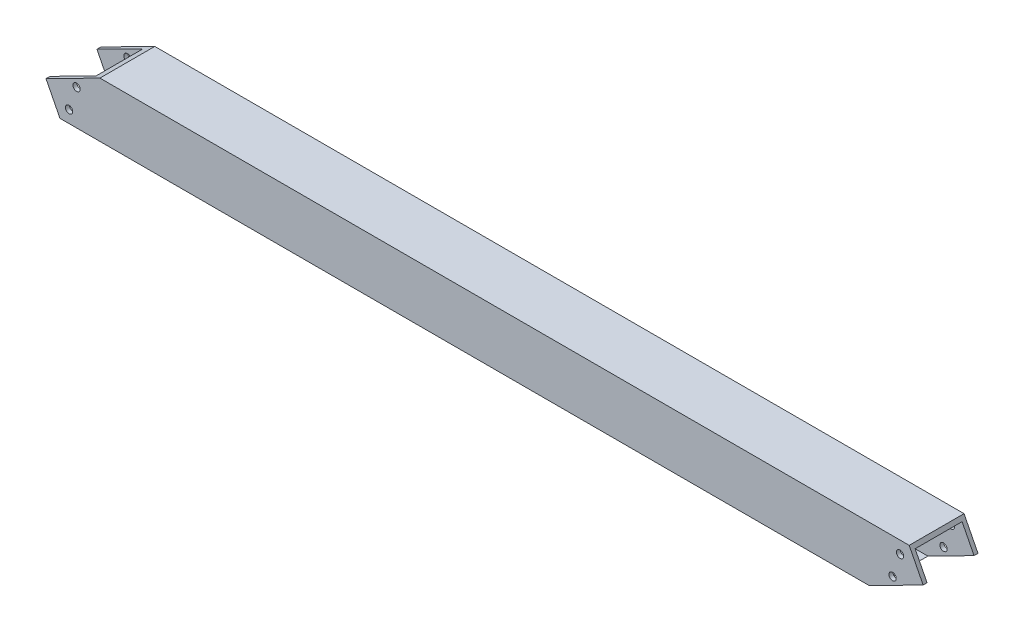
ISO-10303-21;
HEADER;
FILE_DESCRIPTION(('STEP AP214'),'2;1');
FILE_NAME('part.step','',(''),(''),'','','');
FILE_SCHEMA(('AUTOMOTIVE_DESIGN { 1 0 10303 214 1 1 1 1 }'));
ENDSEC;
DATA;
#1=APPLICATION_CONTEXT('core data for automotive mechanical design processes');
#2=APPLICATION_PROTOCOL_DEFINITION('international standard','automotive_design',2000,#1);
#3=PRODUCT_CONTEXT('',#1,'mechanical');
#4=PRODUCT('Part','Part','',(#3));
#5=PRODUCT_RELATED_PRODUCT_CATEGORY('part','',(#4));
#6=PRODUCT_DEFINITION_FORMATION('','',#4);
#7=PRODUCT_DEFINITION_CONTEXT('part definition',#1,'design');
#8=PRODUCT_DEFINITION('design','',#6,#7);
#9=PRODUCT_DEFINITION_SHAPE('','',#8);
#10=(LENGTH_UNIT() NAMED_UNIT(*) SI_UNIT(.MILLI.,.METRE.));
#11=(NAMED_UNIT(*) PLANE_ANGLE_UNIT() SI_UNIT($,.RADIAN.));
#12=(NAMED_UNIT(*) SI_UNIT($,.STERADIAN.) SOLID_ANGLE_UNIT());
#13=UNCERTAINTY_MEASURE_WITH_UNIT(LENGTH_MEASURE(1.E-05),#10,'distance_accuracy_value','');
#14=(GEOMETRIC_REPRESENTATION_CONTEXT(3) GLOBAL_UNCERTAINTY_ASSIGNED_CONTEXT((#13)) GLOBAL_UNIT_ASSIGNED_CONTEXT((#10,
#11,#12)) REPRESENTATION_CONTEXT('',''));
#15=CARTESIAN_POINT('',(0.,0.,0.));
#16=DIRECTION('',(0.,0.,1.));
#17=DIRECTION('',(1.,0.,0.));
#18=AXIS2_PLACEMENT_3D('',#15,#16,#17);
#19=CARTESIAN_POINT('',(3048.,47.1424000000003,-3.65759999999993));
#20=DIRECTION('',(0.,-1.,0.));
#21=DIRECTION('',(0.,0.,-1.));
#22=AXIS2_PLACEMENT_3D('',#19,#20,#21);
#23=PLANE('',#22);
#24=DIRECTION('',(-1.,0.,0.));
#25=VECTOR('',#24,1.);
#26=CARTESIAN_POINT('',(3048.,47.1424000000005,-47.1423999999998));
#27=LINE('',#26,#25);
#28=CARTESIAN_POINT('',(3036.93807719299,47.1424000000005,-47.1423999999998));
#29=VERTEX_POINT('',#28);
#30=CARTESIAN_POINT('',(2278.53059273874,47.1424000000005,-47.1423999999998));
#31=VERTEX_POINT('',#30);
#32=EDGE_CURVE('E195',#29,#31,#27,.T.);
#33=ORIENTED_EDGE('',*,*,#32,.F.);
#34=DIRECTION('',(0.,0.,0.999999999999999));
#35=VECTOR('',#34,1.);
#36=CARTESIAN_POINT('',(3036.93807719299,47.1424000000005,-3.6575999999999));
#37=LINE('',#36,#35);
#38=CARTESIAN_POINT('',(3036.93807719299,47.1424000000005,-3.6575999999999));
#39=VERTEX_POINT('',#38);
#40=EDGE_CURVE('E216',#29,#39,#37,.T.);
#41=ORIENTED_EDGE('',*,*,#40,.T.);
#42=DIRECTION('',(-1.,0.,0.));
#43=VECTOR('',#42,1.);
#44=CARTESIAN_POINT('',(3048.,47.1424000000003,-3.65759999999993));
#45=LINE('',#44,#43);
#46=CARTESIAN_POINT('',(2278.53059273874,47.1424000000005,-3.65759999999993));
#47=VERTEX_POINT('',#46);
#48=EDGE_CURVE('E192',#39,#47,#45,.T.);
#49=ORIENTED_EDGE('',*,*,#48,.T.);
#50=DIRECTION('',(0.,0.,-0.999999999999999));
#51=VECTOR('',#50,1.);
#52=CARTESIAN_POINT('',(2278.53059273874,47.1424000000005,-3.65759999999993));
#53=LINE('',#52,#51);
#54=EDGE_CURVE('E213',#47,#31,#53,.T.);
#55=ORIENTED_EDGE('',*,*,#54,.T.);
#56=EDGE_LOOP('',(#33,#41,#49,#55));
#57=FACE_BOUND('',#56,.T.);
#58=ADVANCED_FACE('F30',(#57),#23,.T.);
#59=CARTESIAN_POINT('',(3048.,47.1424000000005,-47.1423999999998));
#60=DIRECTION('',(0.,0.,1.));
#61=DIRECTION('',(0.,-1.,0.));
#62=AXIS2_PLACEMENT_3D('',#59,#60,#61);
#63=PLANE('',#62);
#64=CARTESIAN_POINT('',(2264.09562739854,32.6736942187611,-47.1423999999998));
#65=DIRECTION('',(0.,0.,1.));
#66=DIRECTION('',(0.,-1.,0.));
#67=AXIS2_PLACEMENT_3D('',#64,#65,#66);
#68=CIRCLE('',#67,3.37312000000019);
#69=CARTESIAN_POINT('',(2267.46874739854,32.6736942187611,-47.1423999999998));
#70=VERTEX_POINT('',#69);
#71=EDGE_CURVE('E350',#70,#70,#68,.T.);
#72=ORIENTED_EDGE('',*,*,#71,.F.);
#73=EDGE_LOOP('',(#72));
#74=FACE_BOUND('',#73,.T.);
#75=CARTESIAN_POINT('',(2257.14522240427,11.3260217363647,-47.1424));
#76=DIRECTION('',(0.,0.,1.));
#77=DIRECTION('',(0.,-1.,0.));
#78=AXIS2_PLACEMENT_3D('',#75,#76,#77);
#79=CIRCLE('',#78,3.37312000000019);
#80=CARTESIAN_POINT('',(2260.51834240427,11.3260217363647,-47.1424));
#81=VERTEX_POINT('',#80);
#82=EDGE_CURVE('E360',#81,#81,#79,.T.);
#83=ORIENTED_EDGE('',*,*,#82,.F.);
#84=EDGE_LOOP('',(#83));
#85=FACE_BOUND('',#84,.T.);
#86=CARTESIAN_POINT('',(3019.69990327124,18.126305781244,-47.1423999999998));
#87=DIRECTION('',(0.,0.,1.));
#88=DIRECTION('',(0.,-1.,0.));
#89=AXIS2_PLACEMENT_3D('',#86,#87,#88);
#90=CIRCLE('',#89,3.37312000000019);
#91=CARTESIAN_POINT('',(3023.07302327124,18.126305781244,-47.1423999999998));
#92=VERTEX_POINT('',#91);
#93=EDGE_CURVE('E297',#92,#92,#90,.T.);
#94=ORIENTED_EDGE('',*,*,#93,.F.);
#95=EDGE_LOOP('',(#94));
#96=FACE_BOUND('',#95,.T.);
#97=CARTESIAN_POINT('',(3026.65030826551,39.47397826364,-47.1423999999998));
#98=DIRECTION('',(0.,0.,1.));
#99=DIRECTION('',(0.,-1.,0.));
#100=AXIS2_PLACEMENT_3D('',#97,#98,#99);
#101=CIRCLE('',#100,3.37312000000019);
#102=CARTESIAN_POINT('',(3030.02342826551,39.47397826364,-47.1423999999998));
#103=VERTEX_POINT('',#102);
#104=EDGE_CURVE('E150',#103,#103,#101,.T.);
#105=ORIENTED_EDGE('',*,*,#104,.F.);
#106=EDGE_LOOP('',(#105));
#107=FACE_BOUND('',#106,.T.);
#108=DIRECTION('',(-1.,0.,0.));
#109=VECTOR('',#108,1.);
#110=CARTESIAN_POINT('',(3048.,3.65760000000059,-47.1423999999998));
#111=LINE('',#110,#109);
#112=CARTESIAN_POINT('',(3005.26493793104,3.65760000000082,-47.1423999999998));
#113=VERTEX_POINT('',#112);
#114=CARTESIAN_POINT('',(2246.85745347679,3.65760000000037,-47.1424));
#115=VERTEX_POINT('',#114);
#116=EDGE_CURVE('E198',#113,#115,#111,.T.);
#117=ORIENTED_EDGE('',*,*,#116,.F.);
#118=DIRECTION('',(0.891278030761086,0.453457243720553,0.));
#119=VECTOR('',#118,1.);
#120=CARTESIAN_POINT('',(3056.78733183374,29.8707477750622,-47.1423999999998));
#121=LINE('',#120,#119);
#122=CARTESIAN_POINT('',(3048.,25.4000000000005,-47.1423999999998));
#123=VERTEX_POINT('',#122);
#124=EDGE_CURVE('E11',#113,#123,#121,.T.);
#125=ORIENTED_EDGE('',*,*,#124,.T.);
#126=DIRECTION('',(-0.453457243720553,0.891278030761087,0.));
#127=VECTOR('',#126,1.);
#128=CARTESIAN_POINT('',(3039.21266816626,42.6716522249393,-47.1423999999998));
#129=LINE('',#128,#127);
#130=EDGE_CURVE('E172',#123,#29,#129,.T.);
#131=ORIENTED_EDGE('',*,*,#130,.T.);
#132=ORIENTED_EDGE('',*,*,#32,.T.);
#133=DIRECTION('',(-0.891278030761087,-0.453457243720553,0.));
#134=VECTOR('',#133,1.);
#135=CARTESIAN_POINT('',(2889.77902897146,358.12844650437,-47.1423999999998));
#136=LINE('',#135,#134);
#137=CARTESIAN_POINT('',(2235.79553066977,25.4000000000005,-47.1423999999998));
#138=VERTEX_POINT('',#137);
#139=EDGE_CURVE('E137',#31,#138,#136,.T.);
#140=ORIENTED_EDGE('',*,*,#139,.T.);
#141=DIRECTION('',(0.453457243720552,-0.891278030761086,0.));
#142=VECTOR('',#141,1.);
#143=CARTESIAN_POINT('',(2394.01650169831,-285.586046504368,-47.1424));
#144=LINE('',#143,#142);
#145=EDGE_CURVE('E38',#138,#115,#144,.T.);
#146=ORIENTED_EDGE('',*,*,#145,.T.);
#147=EDGE_LOOP('',(#117,#125,#131,#132,#140,#146));
#148=FACE_BOUND('',#147,.T.);
#149=ADVANCED_FACE('F221',(#74,#85,#96,#107,#148),#63,.T.);
#150=CARTESIAN_POINT('',(3048.,3.65760000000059,-3.6575999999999));
#151=DIRECTION('',(0.,1.,0.));
#152=DIRECTION('',(0.,0.,1.));
#153=AXIS2_PLACEMENT_3D('',#150,#151,#152);
#154=PLANE('',#153);
#155=DIRECTION('',(-1.,0.,0.));
#156=VECTOR('',#155,1.);
#157=CARTESIAN_POINT('',(3048.,3.65760000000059,-3.6575999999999));
#158=LINE('',#157,#156);
#159=CARTESIAN_POINT('',(3005.26493793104,3.65760000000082,-3.6575999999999));
#160=VERTEX_POINT('',#159);
#161=CARTESIAN_POINT('',(2246.85745347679,3.65760000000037,-3.6575999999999));
#162=VERTEX_POINT('',#161);
#163=EDGE_CURVE('E201',#160,#162,#158,.T.);
#164=ORIENTED_EDGE('',*,*,#163,.F.);
#165=DIRECTION('',(0.,0.,-0.999999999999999));
#166=VECTOR('',#165,1.);
#167=CARTESIAN_POINT('',(3005.26493793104,3.65760000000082,-3.6575999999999));
#168=LINE('',#167,#166);
#169=EDGE_CURVE('E186',#160,#113,#168,.T.);
#170=ORIENTED_EDGE('',*,*,#169,.T.);
#171=ORIENTED_EDGE('',*,*,#116,.T.);
#172=DIRECTION('',(0.,0.,1.));
#173=VECTOR('',#172,1.);
#174=CARTESIAN_POINT('',(2246.85745347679,3.65760000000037,-3.6575999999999));
#175=LINE('',#174,#173);
#176=EDGE_CURVE('E178',#115,#162,#175,.T.);
#177=ORIENTED_EDGE('',*,*,#176,.T.);
#178=EDGE_LOOP('',(#164,#170,#171,#177));
#179=FACE_BOUND('',#178,.T.);
#180=ADVANCED_FACE('F226',(#179),#154,.T.);
#181=CARTESIAN_POINT('',(3048.,47.1424000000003,-3.65759999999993));
#182=DIRECTION('',(0.,0.,-1.));
#183=DIRECTION('',(0.,1.,0.));
#184=AXIS2_PLACEMENT_3D('',#181,#182,#183);
#185=PLANE('',#184);
#186=CARTESIAN_POINT('',(2264.09562739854,32.6736942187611,-3.65759999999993));
#187=DIRECTION('',(0.,0.,-1.));
#188=DIRECTION('',(0.,1.,0.));
#189=AXIS2_PLACEMENT_3D('',#186,#187,#188);
#190=CIRCLE('',#189,3.37312000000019);
#191=CARTESIAN_POINT('',(2267.46874739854,32.6736942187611,-3.65759999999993));
#192=VERTEX_POINT('',#191);
#193=EDGE_CURVE('E343',#192,#192,#190,.T.);
#194=ORIENTED_EDGE('',*,*,#193,.F.);
#195=EDGE_LOOP('',(#194));
#196=FACE_BOUND('',#195,.T.);
#197=CARTESIAN_POINT('',(2257.14522240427,11.3260217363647,-3.6575999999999));
#198=DIRECTION('',(0.,0.,-1.));
#199=DIRECTION('',(0.,1.,0.));
#200=AXIS2_PLACEMENT_3D('',#197,#198,#199);
#201=CIRCLE('',#200,3.37312000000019);
#202=CARTESIAN_POINT('',(2260.51834240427,11.3260217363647,-3.65759999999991));
#203=VERTEX_POINT('',#202);
#204=EDGE_CURVE('E356',#203,#203,#201,.T.);
#205=ORIENTED_EDGE('',*,*,#204,.F.);
#206=EDGE_LOOP('',(#205));
#207=FACE_BOUND('',#206,.T.);
#208=CARTESIAN_POINT('',(3019.69990327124,18.126305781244,-3.6575999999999));
#209=DIRECTION('',(0.,0.,-1.));
#210=DIRECTION('',(0.,1.,0.));
#211=AXIS2_PLACEMENT_3D('',#208,#209,#210);
#212=CIRCLE('',#211,3.37312000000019);
#213=CARTESIAN_POINT('',(3023.07302327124,18.126305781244,-3.65759999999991));
#214=VERTEX_POINT('',#213);
#215=EDGE_CURVE('E303',#214,#214,#212,.T.);
#216=ORIENTED_EDGE('',*,*,#215,.F.);
#217=EDGE_LOOP('',(#216));
#218=FACE_BOUND('',#217,.T.);
#219=CARTESIAN_POINT('',(3026.6503082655,39.4739782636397,-3.6575999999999));
#220=DIRECTION('',(0.,0.,-1.));
#221=DIRECTION('',(0.,1.,0.));
#222=AXIS2_PLACEMENT_3D('',#219,#220,#221);
#223=CIRCLE('',#222,3.37312000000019);
#224=CARTESIAN_POINT('',(3030.02342826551,39.47397826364,-3.65759999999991));
#225=VERTEX_POINT('',#224);
#226=EDGE_CURVE('E300',#225,#225,#223,.T.);
#227=ORIENTED_EDGE('',*,*,#226,.F.);
#228=EDGE_LOOP('',(#227));
#229=FACE_BOUND('',#228,.T.);
#230=DIRECTION('',(0.453457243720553,-0.891278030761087,0.));
#231=VECTOR('',#230,1.);
#232=CARTESIAN_POINT('',(3039.21266816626,42.6716522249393,-3.65759999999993));
#233=LINE('',#232,#231);
#234=CARTESIAN_POINT('',(3048.,25.4000000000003,-3.6575999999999));
#235=VERTEX_POINT('',#234);
#236=EDGE_CURVE('E175',#39,#235,#233,.T.);
#237=ORIENTED_EDGE('',*,*,#236,.T.);
#238=DIRECTION('',(-0.891278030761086,-0.453457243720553,0.));
#239=VECTOR('',#238,1.);
#240=CARTESIAN_POINT('',(3056.78733183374,29.8707477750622,-3.6575999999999));
#241=LINE('',#240,#239);
#242=EDGE_CURVE('E136',#235,#160,#241,.T.);
#243=ORIENTED_EDGE('',*,*,#242,.T.);
#244=ORIENTED_EDGE('',*,*,#163,.T.);
#245=DIRECTION('',(-0.453457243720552,0.891278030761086,0.));
#246=VECTOR('',#245,1.);
#247=CARTESIAN_POINT('',(2394.01650169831,-285.586046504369,-3.6575999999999));
#248=LINE('',#247,#246);
#249=CARTESIAN_POINT('',(2235.79553066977,25.4000000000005,-3.6575999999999));
#250=VERTEX_POINT('',#249);
#251=EDGE_CURVE('E181',#162,#250,#248,.T.);
#252=ORIENTED_EDGE('',*,*,#251,.T.);
#253=DIRECTION('',(0.891278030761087,0.453457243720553,0.));
#254=VECTOR('',#253,1.);
#255=CARTESIAN_POINT('',(2889.77902897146,358.12844650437,-3.65759999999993));
#256=LINE('',#255,#254);
#257=EDGE_CURVE('E167',#250,#47,#256,.T.);
#258=ORIENTED_EDGE('',*,*,#257,.T.);
#259=ORIENTED_EDGE('',*,*,#48,.F.);
#260=EDGE_LOOP('',(#237,#243,#244,#252,#258,#259));
#261=FACE_BOUND('',#260,.T.);
#262=ADVANCED_FACE('F229',(#196,#207,#218,#229,#261),#185,.T.);
#263=CARTESIAN_POINT('',(2880.99169713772,353.657698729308,0.));
#264=DIRECTION('',(-0.453457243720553,0.891278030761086,0.));
#265=DIRECTION('',(-0.891278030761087,-0.453457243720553,0.));
#266=AXIS2_PLACEMENT_3D('',#263,#264,#265);
#267=PLANE('',#266);
#268=DIRECTION('',(0.,0.,-0.999999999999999));
#269=VECTOR('',#268,1.);
#270=CARTESIAN_POINT('',(2285.71966860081,50.8000000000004,0.));
#271=LINE('',#270,#269);
#272=CARTESIAN_POINT('',(2285.71966860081,50.8000000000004,0.));
#273=VERTEX_POINT('',#272);
#274=CARTESIAN_POINT('',(2285.71966860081,50.8000000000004,-50.7999999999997));
#275=VERTEX_POINT('',#274);
#276=EDGE_CURVE('E170',#273,#275,#271,.T.);
#277=ORIENTED_EDGE('',*,*,#276,.T.);
#278=DIRECTION('',(0.891278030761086,0.453457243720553,0.));
#279=VECTOR('',#278,1.);
#280=CARTESIAN_POINT('',(2880.99169713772,353.657698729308,-50.7999999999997));
#281=LINE('',#280,#279);
#282=CARTESIAN_POINT('',(2235.79553066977,25.4000000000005,-50.7999999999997));
#283=VERTEX_POINT('',#282);
#284=EDGE_CURVE('E147',#283,#275,#281,.T.);
#285=ORIENTED_EDGE('',*,*,#284,.F.);
#286=DIRECTION('',(0.,0.,-1.));
#287=VECTOR('',#286,1.);
#288=CARTESIAN_POINT('',(2235.79553066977,25.4000000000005,0.));
#289=LINE('',#288,#287);
#290=EDGE_CURVE('E129',#138,#283,#289,.T.);
#291=ORIENTED_EDGE('',*,*,#290,.F.);
#292=ORIENTED_EDGE('',*,*,#139,.F.);
#293=ORIENTED_EDGE('',*,*,#54,.F.);
#294=ORIENTED_EDGE('',*,*,#257,.F.);
#295=CARTESIAN_POINT('',(2235.79553066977,25.4000000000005,0.));
#296=VERTEX_POINT('',#295);
#297=EDGE_CURVE('E162',#296,#250,#289,.T.);
#298=ORIENTED_EDGE('',*,*,#297,.F.);
#299=DIRECTION('',(0.891278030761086,0.453457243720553,0.));
#300=VECTOR('',#299,1.);
#301=CARTESIAN_POINT('',(2880.99169713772,353.657698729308,0.));
#302=LINE('',#301,#300);
#303=EDGE_CURVE('E53',#296,#273,#302,.T.);
#304=ORIENTED_EDGE('',*,*,#303,.T.);
#305=EDGE_LOOP('',(#277,#285,#291,#292,#293,#294,#298,#304));
#306=FACE_BOUND('',#305,.T.);
#307=ADVANCED_FACE('F245',(#306),#267,.T.);
#308=CARTESIAN_POINT('',(2235.79553066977,25.4000000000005,0.));
#309=DIRECTION('',(-0.891278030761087,-0.453457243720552,0.));
#310=DIRECTION('',(0.453457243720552,-0.891278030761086,0.));
#311=AXIS2_PLACEMENT_3D('',#308,#309,#310);
#312=PLANE('',#311);
#313=DIRECTION('',(0.,0.,1.));
#314=VECTOR('',#313,1.);
#315=CARTESIAN_POINT('',(2248.71833768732,6.66133814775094E-13,0.));
#316=LINE('',#315,#314);
#317=CARTESIAN_POINT('',(2248.71833768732,6.66133814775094E-13,-50.7999999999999));
#318=VERTEX_POINT('',#317);
#319=CARTESIAN_POINT('',(2248.71833768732,6.66133814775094E-13,0.));
#320=VERTEX_POINT('',#319);
#321=EDGE_CURVE('E184',#318,#320,#316,.T.);
#322=ORIENTED_EDGE('',*,*,#321,.T.);
#323=DIRECTION('',(-0.453457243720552,0.891278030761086,0.));
#324=VECTOR('',#323,1.);
#325=CARTESIAN_POINT('',(2235.79553066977,25.4000000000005,0.));
#326=LINE('',#325,#324);
#327=EDGE_CURVE('E144',#320,#296,#326,.T.);
#328=ORIENTED_EDGE('',*,*,#327,.T.);
#329=ORIENTED_EDGE('',*,*,#297,.T.);
#330=ORIENTED_EDGE('',*,*,#251,.F.);
#331=ORIENTED_EDGE('',*,*,#176,.F.);
#332=ORIENTED_EDGE('',*,*,#145,.F.);
#333=ORIENTED_EDGE('',*,*,#290,.T.);
#334=DIRECTION('',(-0.453457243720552,0.891278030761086,0.));
#335=VECTOR('',#334,1.);
#336=CARTESIAN_POINT('',(2235.79553066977,25.4000000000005,-50.7999999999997));
#337=LINE('',#336,#335);
#338=EDGE_CURVE('E157',#318,#283,#337,.T.);
#339=ORIENTED_EDGE('',*,*,#338,.F.);
#340=EDGE_LOOP('',(#322,#328,#329,#330,#331,#332,#333,#339));
#341=FACE_BOUND('',#340,.T.);
#342=ADVANCED_FACE('F244',(#341),#312,.T.);
#343=CARTESIAN_POINT('',(2402.80383353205,-302.857698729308,0.));
#344=DIRECTION('',(0.453457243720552,-0.891278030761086,0.));
#345=DIRECTION('',(0.891278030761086,0.453457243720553,0.));
#346=AXIS2_PLACEMENT_3D('',#343,#344,#345);
#347=PLANE('',#346);
#348=DIRECTION('',(0.,0.,-0.999999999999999));
#349=VECTOR('',#348,1.);
#350=CARTESIAN_POINT('',(2998.07586206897,2.22044604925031E-13,0.));
#351=LINE('',#350,#349);
#352=CARTESIAN_POINT('',(2998.07586206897,2.22044604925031E-13,0.));
#353=VERTEX_POINT('',#352);
#354=CARTESIAN_POINT('',(2998.07586206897,2.22044604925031E-13,-50.7999999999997));
#355=VERTEX_POINT('',#354);
#356=EDGE_CURVE('E190',#353,#355,#351,.T.);
#357=ORIENTED_EDGE('',*,*,#356,.T.);
#358=DIRECTION('',(-0.891278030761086,-0.453457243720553,0.));
#359=VECTOR('',#358,1.);
#360=CARTESIAN_POINT('',(2402.80383353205,-302.857698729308,-50.7999999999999));
#361=LINE('',#360,#359);
#362=CARTESIAN_POINT('',(3048.,25.4000000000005,-50.7999999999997));
#363=VERTEX_POINT('',#362);
#364=EDGE_CURVE('E154',#363,#355,#361,.T.);
#365=ORIENTED_EDGE('',*,*,#364,.F.);
#366=DIRECTION('',(0.,0.,-1.));
#367=VECTOR('',#366,1.);
#368=CARTESIAN_POINT('',(3048.,25.4000000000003,0.));
#369=LINE('',#368,#367);
#370=EDGE_CURVE('E138',#123,#363,#369,.T.);
#371=ORIENTED_EDGE('',*,*,#370,.F.);
#372=ORIENTED_EDGE('',*,*,#124,.F.);
#373=ORIENTED_EDGE('',*,*,#169,.F.);
#374=ORIENTED_EDGE('',*,*,#242,.F.);
#375=CARTESIAN_POINT('',(3048.,25.4000000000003,0.));
#376=VERTEX_POINT('',#375);
#377=EDGE_CURVE('E122',#376,#235,#369,.T.);
#378=ORIENTED_EDGE('',*,*,#377,.F.);
#379=DIRECTION('',(-0.891278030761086,-0.453457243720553,0.));
#380=VECTOR('',#379,1.);
#381=CARTESIAN_POINT('',(2402.80383353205,-302.857698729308,0.));
#382=LINE('',#381,#380);
#383=EDGE_CURVE('E133',#376,#353,#382,.T.);
#384=ORIENTED_EDGE('',*,*,#383,.T.);
#385=EDGE_LOOP('',(#357,#365,#371,#372,#373,#374,#378,#384));
#386=FACE_BOUND('',#385,.T.);
#387=ADVANCED_FACE('F132',(#386),#347,.T.);
#388=CARTESIAN_POINT('',(3048.,25.4000000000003,0.));
#389=DIRECTION('',(0.891278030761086,0.453457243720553,0.));
#390=DIRECTION('',(-0.453457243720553,0.891278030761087,0.));
#391=AXIS2_PLACEMENT_3D('',#388,#389,#390);
#392=PLANE('',#391);
#393=DIRECTION('',(0.,0.,0.999999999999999));
#394=VECTOR('',#393,1.);
#395=CARTESIAN_POINT('',(3035.07719298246,50.8000000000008,0.));
#396=LINE('',#395,#394);
#397=CARTESIAN_POINT('',(3035.07719298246,50.8000000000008,-50.7999999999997));
#398=VERTEX_POINT('',#397);
#399=CARTESIAN_POINT('',(3035.07719298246,50.8000000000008,0.));
#400=VERTEX_POINT('',#399);
#401=EDGE_CURVE('E124',#398,#400,#396,.T.);
#402=ORIENTED_EDGE('',*,*,#401,.T.);
#403=DIRECTION('',(0.453457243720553,-0.891278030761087,0.));
#404=VECTOR('',#403,1.);
#405=CARTESIAN_POINT('',(3048.,25.4000000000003,0.));
#406=LINE('',#405,#404);
#407=EDGE_CURVE('E119',#400,#376,#406,.T.);
#408=ORIENTED_EDGE('',*,*,#407,.T.);
#409=ORIENTED_EDGE('',*,*,#377,.T.);
#410=ORIENTED_EDGE('',*,*,#236,.F.);
#411=ORIENTED_EDGE('',*,*,#40,.F.);
#412=ORIENTED_EDGE('',*,*,#130,.F.);
#413=ORIENTED_EDGE('',*,*,#370,.T.);
#414=DIRECTION('',(0.453457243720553,-0.891278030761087,0.));
#415=VECTOR('',#414,1.);
#416=CARTESIAN_POINT('',(3048.,25.4000000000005,-50.7999999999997));
#417=LINE('',#416,#415);
#418=EDGE_CURVE('E45',#398,#363,#417,.T.);
#419=ORIENTED_EDGE('',*,*,#418,.F.);
#420=EDGE_LOOP('',(#402,#408,#409,#410,#411,#412,#413,#419));
#421=FACE_BOUND('',#420,.T.);
#422=ADVANCED_FACE('F121',(#421),#392,.T.);
#423=CARTESIAN_POINT('',(3048.,6.66133814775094E-13,0.));
#424=DIRECTION('',(0.,0.,-1.));
#425=DIRECTION('',(-1.,0.,0.));
#426=AXIS2_PLACEMENT_3D('',#423,#424,#425);
#427=PLANE('',#426);
#428=CARTESIAN_POINT('',(2264.09562739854,32.6736942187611,0.));
#429=DIRECTION('',(0.,0.,1.));
#430=DIRECTION('',(1.,0.,0.));
#431=AXIS2_PLACEMENT_3D('',#428,#429,#430);
#432=CIRCLE('',#431,3.37312000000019);
#433=CARTESIAN_POINT('',(2267.46874739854,32.6736942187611,0.));
#434=VERTEX_POINT('',#433);
#435=EDGE_CURVE('E283',#434,#434,#432,.T.);
#436=ORIENTED_EDGE('',*,*,#435,.F.);
#437=EDGE_LOOP('',(#436));
#438=FACE_BOUND('',#437,.T.);
#439=CARTESIAN_POINT('',(2257.14522240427,11.3260217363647,0.));
#440=DIRECTION('',(0.,0.,1.));
#441=DIRECTION('',(1.,0.,0.));
#442=AXIS2_PLACEMENT_3D('',#439,#440,#441);
#443=CIRCLE('',#442,3.37312000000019);
#444=CARTESIAN_POINT('',(2260.51834240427,11.3260217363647,0.));
#445=VERTEX_POINT('',#444);
#446=EDGE_CURVE('E287',#445,#445,#443,.T.);
#447=ORIENTED_EDGE('',*,*,#446,.F.);
#448=EDGE_LOOP('',(#447));
#449=FACE_BOUND('',#448,.T.);
#450=CARTESIAN_POINT('',(3019.69990327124,18.126305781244,0.));
#451=DIRECTION('',(0.,0.,1.));
#452=DIRECTION('',(1.,0.,0.));
#453=AXIS2_PLACEMENT_3D('',#450,#451,#452);
#454=CIRCLE('',#453,3.37312000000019);
#455=CARTESIAN_POINT('',(3023.07302327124,18.126305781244,0.));
#456=VERTEX_POINT('',#455);
#457=EDGE_CURVE('E291',#456,#456,#454,.T.);
#458=ORIENTED_EDGE('',*,*,#457,.F.);
#459=EDGE_LOOP('',(#458));
#460=FACE_BOUND('',#459,.T.);
#461=CARTESIAN_POINT('',(3026.6503082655,39.4739782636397,0.));
#462=DIRECTION('',(0.,0.,1.));
#463=DIRECTION('',(1.,0.,0.));
#464=AXIS2_PLACEMENT_3D('',#461,#462,#463);
#465=CIRCLE('',#464,3.37312000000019);
#466=CARTESIAN_POINT('',(3030.02342826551,39.47397826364,0.));
#467=VERTEX_POINT('',#466);
#468=EDGE_CURVE('E294',#467,#467,#465,.T.);
#469=ORIENTED_EDGE('',*,*,#468,.F.);
#470=EDGE_LOOP('',(#469));
#471=FACE_BOUND('',#470,.T.);
#472=ORIENTED_EDGE('',*,*,#383,.F.);
#473=ORIENTED_EDGE('',*,*,#407,.F.);
#474=DIRECTION('',(-1.,0.,0.));
#475=VECTOR('',#474,1.);
#476=CARTESIAN_POINT('',(3048.,50.8000000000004,0.));
#477=LINE('',#476,#475);
#478=EDGE_CURVE('E204',#400,#273,#477,.T.);
#479=ORIENTED_EDGE('',*,*,#478,.T.);
#480=ORIENTED_EDGE('',*,*,#303,.F.);
#481=ORIENTED_EDGE('',*,*,#327,.F.);
#482=DIRECTION('',(-1.,0.,0.));
#483=VECTOR('',#482,1.);
#484=CARTESIAN_POINT('',(3048.,6.66133814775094E-13,0.));
#485=LINE('',#484,#483);
#486=EDGE_CURVE('E143',#353,#320,#485,.T.);
#487=ORIENTED_EDGE('',*,*,#486,.F.);
#488=EDGE_LOOP('',(#472,#473,#479,#480,#481,#487));
#489=FACE_BOUND('',#488,.T.);
#490=ADVANCED_FACE('F32',(#438,#449,#460,#471,#489),#427,.F.);
#491=CARTESIAN_POINT('',(3048.,6.66133814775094E-13,0.));
#492=DIRECTION('',(0.,1.,0.));
#493=DIRECTION('',(0.,0.,1.));
#494=AXIS2_PLACEMENT_3D('',#491,#492,#493);
#495=PLANE('',#494);
#496=ORIENTED_EDGE('',*,*,#356,.F.);
#497=ORIENTED_EDGE('',*,*,#486,.T.);
#498=ORIENTED_EDGE('',*,*,#321,.F.);
#499=DIRECTION('',(-1.,0.,0.));
#500=VECTOR('',#499,1.);
#501=CARTESIAN_POINT('',(3048.,6.66133814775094E-13,-50.7999999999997));
#502=LINE('',#501,#500);
#503=EDGE_CURVE('E209',#355,#318,#502,.T.);
#504=ORIENTED_EDGE('',*,*,#503,.F.);
#505=EDGE_LOOP('',(#496,#497,#498,#504));
#506=FACE_BOUND('',#505,.T.);
#507=ADVANCED_FACE('F243',(#506),#495,.F.);
#508=CARTESIAN_POINT('',(3048.,6.66133814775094E-13,-50.7999999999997));
#509=DIRECTION('',(0.,0.,1.));
#510=DIRECTION('',(1.,0.,0.));
#511=AXIS2_PLACEMENT_3D('',#508,#509,#510);
#512=PLANE('',#511);
#513=CARTESIAN_POINT('',(2264.09562739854,32.6736942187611,-50.7999999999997));
#514=DIRECTION('',(0.,0.,1.));
#515=DIRECTION('',(1.,0.,0.));
#516=AXIS2_PLACEMENT_3D('',#513,#514,#515);
#517=CIRCLE('',#516,3.37312000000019);
#518=CARTESIAN_POINT('',(2267.46874739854,32.6736942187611,-50.7999999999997));
#519=VERTEX_POINT('',#518);
#520=EDGE_CURVE('E344',#519,#519,#517,.T.);
#521=ORIENTED_EDGE('',*,*,#520,.T.);
#522=EDGE_LOOP('',(#521));
#523=FACE_BOUND('',#522,.T.);
#524=CARTESIAN_POINT('',(2257.14522240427,11.3260217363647,-50.7999999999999));
#525=DIRECTION('',(0.,0.,1.));
#526=DIRECTION('',(1.,0.,0.));
#527=AXIS2_PLACEMENT_3D('',#524,#525,#526);
#528=CIRCLE('',#527,3.37312000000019);
#529=CARTESIAN_POINT('',(2260.51834240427,11.3260217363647,-50.7999999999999));
#530=VERTEX_POINT('',#529);
#531=EDGE_CURVE('E353',#530,#530,#528,.T.);
#532=ORIENTED_EDGE('',*,*,#531,.T.);
#533=EDGE_LOOP('',(#532));
#534=FACE_BOUND('',#533,.T.);
#535=CARTESIAN_POINT('',(3019.69990327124,18.126305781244,-50.7999999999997));
#536=DIRECTION('',(0.,0.,1.));
#537=DIRECTION('',(1.,0.,0.));
#538=AXIS2_PLACEMENT_3D('',#535,#536,#537);
#539=CIRCLE('',#538,3.37312000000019);
#540=CARTESIAN_POINT('',(3023.07302327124,18.126305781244,-50.7999999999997));
#541=VERTEX_POINT('',#540);
#542=EDGE_CURVE('E363',#541,#541,#539,.T.);
#543=ORIENTED_EDGE('',*,*,#542,.T.);
#544=EDGE_LOOP('',(#543));
#545=FACE_BOUND('',#544,.T.);
#546=CARTESIAN_POINT('',(3026.65030826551,39.47397826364,-50.7999999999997));
#547=DIRECTION('',(0.,0.,1.));
#548=DIRECTION('',(1.,0.,0.));
#549=AXIS2_PLACEMENT_3D('',#546,#547,#548);
#550=CIRCLE('',#549,3.37312000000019);
#551=CARTESIAN_POINT('',(3030.02342826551,39.47397826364,-50.7999999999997));
#552=VERTEX_POINT('',#551);
#553=EDGE_CURVE('E296',#552,#552,#550,.T.);
#554=ORIENTED_EDGE('',*,*,#553,.T.);
#555=EDGE_LOOP('',(#554));
#556=FACE_BOUND('',#555,.T.);
#557=ORIENTED_EDGE('',*,*,#364,.T.);
#558=ORIENTED_EDGE('',*,*,#503,.T.);
#559=ORIENTED_EDGE('',*,*,#338,.T.);
#560=ORIENTED_EDGE('',*,*,#284,.T.);
#561=DIRECTION('',(-1.,0.,0.));
#562=VECTOR('',#561,1.);
#563=CARTESIAN_POINT('',(3048.,50.8000000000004,-50.7999999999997));
#564=LINE('',#563,#562);
#565=EDGE_CURVE('E206',#398,#275,#564,.T.);
#566=ORIENTED_EDGE('',*,*,#565,.F.);
#567=ORIENTED_EDGE('',*,*,#418,.T.);
#568=EDGE_LOOP('',(#557,#558,#559,#560,#566,#567));
#569=FACE_BOUND('',#568,.T.);
#570=ADVANCED_FACE('F237',(#523,#534,#545,#556,#569),#512,.F.);
#571=CARTESIAN_POINT('',(3048.,50.8000000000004,0.));
#572=DIRECTION('',(0.,-1.,0.));
#573=DIRECTION('',(0.,0.,-1.));
#574=AXIS2_PLACEMENT_3D('',#571,#572,#573);
#575=PLANE('',#574);
#576=ORIENTED_EDGE('',*,*,#401,.F.);
#577=ORIENTED_EDGE('',*,*,#565,.T.);
#578=ORIENTED_EDGE('',*,*,#276,.F.);
#579=ORIENTED_EDGE('',*,*,#478,.F.);
#580=EDGE_LOOP('',(#576,#577,#578,#579));
#581=FACE_BOUND('',#580,.T.);
#582=ADVANCED_FACE('F240',(#581),#575,.F.);
#583=CARTESIAN_POINT('',(3026.65030826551,39.47397826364,-50.7999999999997));
#584=DIRECTION('',(0.,0.,1.));
#585=DIRECTION('',(1.,0.,0.));
#586=AXIS2_PLACEMENT_3D('',#583,#584,#585);
#587=CYLINDRICAL_SURFACE('',#586,3.37312000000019);
#588=CARTESIAN_POINT('',(3030.02342826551,39.47397826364,-47.1423999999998));
#589=CARTESIAN_POINT('',(3030.02342826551,39.47397826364,-47.1804999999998));
#590=CARTESIAN_POINT('',(3030.02342826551,39.47397826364,-47.2185999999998));
#591=CARTESIAN_POINT('',(3030.02342826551,39.47397826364,-47.2947999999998));
#592=CARTESIAN_POINT('',(3030.02342826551,39.47397826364,-47.3328999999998));
#593=CARTESIAN_POINT('',(3030.02342826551,39.47397826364,-47.4090999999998));
#594=CARTESIAN_POINT('',(3030.02342826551,39.47397826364,-47.4471999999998));
#595=CARTESIAN_POINT('',(3030.02342826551,39.47397826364,-47.5233999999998));
#596=CARTESIAN_POINT('',(3030.02342826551,39.47397826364,-47.5614999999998));
#597=CARTESIAN_POINT('',(3030.02342826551,39.47397826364,-47.6376999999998));
#598=CARTESIAN_POINT('',(3030.02342826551,39.47397826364,-47.6757999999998));
#599=CARTESIAN_POINT('',(3030.02342826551,39.47397826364,-47.7519999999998));
#600=CARTESIAN_POINT('',(3030.02342826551,39.47397826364,-47.7900999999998));
#601=CARTESIAN_POINT('',(3030.02342826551,39.47397826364,-47.8662999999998));
#602=CARTESIAN_POINT('',(3030.02342826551,39.47397826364,-47.9043999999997));
#603=CARTESIAN_POINT('',(3030.02342826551,39.47397826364,-47.9805999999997));
#604=CARTESIAN_POINT('',(3030.02342826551,39.47397826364,-48.0186999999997));
#605=CARTESIAN_POINT('',(3030.02342826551,39.47397826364,-48.0948999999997));
#606=CARTESIAN_POINT('',(3030.02342826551,39.47397826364,-48.1329999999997));
#607=CARTESIAN_POINT('',(3030.02342826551,39.47397826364,-48.2091999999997));
#608=CARTESIAN_POINT('',(3030.02342826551,39.47397826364,-48.2472999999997));
#609=CARTESIAN_POINT('',(3030.02342826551,39.47397826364,-48.3234999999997));
#610=CARTESIAN_POINT('',(3030.02342826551,39.47397826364,-48.3615999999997));
#611=CARTESIAN_POINT('',(3030.02342826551,39.47397826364,-48.4377999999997));
#612=CARTESIAN_POINT('',(3030.02342826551,39.47397826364,-48.4758999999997));
#613=CARTESIAN_POINT('',(3030.02342826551,39.47397826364,-48.5520999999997));
#614=CARTESIAN_POINT('',(3030.02342826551,39.47397826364,-48.5901999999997));
#615=CARTESIAN_POINT('',(3030.02342826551,39.47397826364,-48.6663999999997));
#616=CARTESIAN_POINT('',(3030.02342826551,39.47397826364,-48.7044999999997));
#617=CARTESIAN_POINT('',(3030.02342826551,39.47397826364,-48.7806999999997));
#618=CARTESIAN_POINT('',(3030.02342826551,39.47397826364,-48.8187999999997));
#619=CARTESIAN_POINT('',(3030.02342826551,39.47397826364,-48.8949999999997));
#620=CARTESIAN_POINT('',(3030.02342826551,39.47397826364,-48.9330999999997));
#621=CARTESIAN_POINT('',(3030.02342826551,39.47397826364,-49.0092999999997));
#622=CARTESIAN_POINT('',(3030.02342826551,39.47397826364,-49.0473999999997));
#623=CARTESIAN_POINT('',(3030.02342826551,39.47397826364,-49.1235999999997));
#624=CARTESIAN_POINT('',(3030.02342826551,39.47397826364,-49.1616999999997));
#625=CARTESIAN_POINT('',(3030.02342826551,39.47397826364,-49.2378999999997));
#626=CARTESIAN_POINT('',(3030.02342826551,39.47397826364,-49.2759999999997));
#627=CARTESIAN_POINT('',(3030.02342826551,39.47397826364,-49.3521999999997));
#628=CARTESIAN_POINT('',(3030.02342826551,39.47397826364,-49.3902999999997));
#629=CARTESIAN_POINT('',(3030.02342826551,39.47397826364,-49.4664999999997));
#630=CARTESIAN_POINT('',(3030.02342826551,39.47397826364,-49.5045999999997));
#631=CARTESIAN_POINT('',(3030.02342826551,39.47397826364,-49.5807999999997));
#632=CARTESIAN_POINT('',(3030.02342826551,39.47397826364,-49.6188999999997));
#633=CARTESIAN_POINT('',(3030.02342826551,39.47397826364,-49.6950999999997));
#634=CARTESIAN_POINT('',(3030.02342826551,39.47397826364,-49.7331999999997));
#635=CARTESIAN_POINT('',(3030.02342826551,39.47397826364,-49.8093999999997));
#636=CARTESIAN_POINT('',(3030.02342826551,39.47397826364,-49.8474999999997));
#637=CARTESIAN_POINT('',(3030.02342826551,39.47397826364,-49.9236999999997));
#638=CARTESIAN_POINT('',(3030.02342826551,39.47397826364,-49.9617999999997));
#639=CARTESIAN_POINT('',(3030.02342826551,39.47397826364,-50.0379999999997));
#640=CARTESIAN_POINT('',(3030.02342826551,39.47397826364,-50.0760999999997));
#641=CARTESIAN_POINT('',(3030.02342826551,39.47397826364,-50.1522999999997));
#642=CARTESIAN_POINT('',(3030.02342826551,39.47397826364,-50.1903999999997));
#643=CARTESIAN_POINT('',(3030.02342826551,39.47397826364,-50.2665999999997));
#644=CARTESIAN_POINT('',(3030.02342826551,39.47397826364,-50.3046999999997));
#645=CARTESIAN_POINT('',(3030.02342826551,39.47397826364,-50.3808999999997));
#646=CARTESIAN_POINT('',(3030.02342826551,39.47397826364,-50.4189999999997));
#647=CARTESIAN_POINT('',(3030.02342826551,39.47397826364,-50.4951999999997));
#648=CARTESIAN_POINT('',(3030.02342826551,39.47397826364,-50.5332999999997));
#649=CARTESIAN_POINT('',(3030.02342826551,39.47397826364,-50.6094999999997));
#650=CARTESIAN_POINT('',(3030.02342826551,39.47397826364,-50.6475999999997));
#651=CARTESIAN_POINT('',(3030.02342826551,39.47397826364,-50.7237999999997));
#652=CARTESIAN_POINT('',(3030.02342826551,39.47397826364,-50.7618999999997));
#653=CARTESIAN_POINT('',(3030.02342826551,39.47397826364,-50.7999999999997));
#654=B_SPLINE_CURVE_WITH_KNOTS('',3,(#588,#589,#590,#591,#592,#593,#594,#595,#596,#597,#598,
#599,#600,#601,#602,#603,#604,#605,#606,#607,#608,#609,#610,#611,#612,#613,#614,#615,#616,#617,
#618,#619,#620,#621,#622,#623,#624,#625,#626,#627,#628,#629,#630,#631,#632,#633,#634,#635,#636,
#637,#638,#639,#640,#641,#642,#643,#644,#645,#646,#647,#648,#649,#650,#651,#652,#653),
.UNSPECIFIED.,.F.,.F.,(4,2,2,2,2,2,2,2,2,2,2,2,2,2,2,2,2,2,2,2,2,2,2,2,2,2,2,2,2,2,2,2,4),(0.,
0.114299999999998,0.228599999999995,0.342899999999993,0.457199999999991,0.571499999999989,
0.685799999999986,0.800099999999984,0.914399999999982,1.02869999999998,1.14299999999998,
1.25729999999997,1.37159999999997,1.48589999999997,1.60019999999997,1.71449999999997,
1.82879999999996,1.94309999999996,2.05739999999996,2.17169999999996,2.28599999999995,
2.40029999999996,2.51459999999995,2.62889999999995,2.74319999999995,2.85749999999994,
2.97179999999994,3.08609999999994,3.20039999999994,3.31469999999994,3.42899999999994,
3.54329999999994,3.65759999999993),.UNSPECIFIED.);
#655=EDGE_CURVE('BSEAM269',#103,#552,#654,.T.);
#656=ORIENTED_EDGE('',*,*,#104,.T.);
#657=ORIENTED_EDGE('',*,*,#553,.F.);
#658=ORIENTED_EDGE('',*,*,#655,.T.);
#659=ORIENTED_EDGE('',*,*,#655,.F.);
#660=EDGE_LOOP('',(#656,#658,#657,#659));
#661=FACE_BOUND('',#660,.T.);
#662=ADVANCED_FACE('F269',(#661),#587,.F.);
#663=CARTESIAN_POINT('',(3030.02342826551,39.47397826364,-3.65759999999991));
#664=CARTESIAN_POINT('',(3030.02342826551,39.47397826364,-3.61949999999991));
#665=CARTESIAN_POINT('',(3030.02342826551,39.47397826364,-3.58139999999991));
#666=CARTESIAN_POINT('',(3030.02342826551,39.47397826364,-3.50519999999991));
#667=CARTESIAN_POINT('',(3030.02342826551,39.47397826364,-3.46709999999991));
#668=CARTESIAN_POINT('',(3030.02342826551,39.47397826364,-3.39089999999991));
#669=CARTESIAN_POINT('',(3030.02342826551,39.47397826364,-3.35279999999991));
#670=CARTESIAN_POINT('',(3030.02342826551,39.47397826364,-3.27659999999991));
#671=CARTESIAN_POINT('',(3030.02342826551,39.47397826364,-3.23849999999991));
#672=CARTESIAN_POINT('',(3030.02342826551,39.47397826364,-3.16229999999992));
#673=CARTESIAN_POINT('',(3030.02342826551,39.47397826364,-3.12419999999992));
#674=CARTESIAN_POINT('',(3030.02342826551,39.47397826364,-3.04799999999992));
#675=CARTESIAN_POINT('',(3030.02342826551,39.47397826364,-3.00989999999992));
#676=CARTESIAN_POINT('',(3030.02342826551,39.47397826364,-2.93369999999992));
#677=CARTESIAN_POINT('',(3030.02342826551,39.47397826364,-2.89559999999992));
#678=CARTESIAN_POINT('',(3030.02342826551,39.47397826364,-2.81939999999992));
#679=CARTESIAN_POINT('',(3030.02342826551,39.47397826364,-2.78129999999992));
#680=CARTESIAN_POINT('',(3030.02342826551,39.47397826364,-2.70509999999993));
#681=CARTESIAN_POINT('',(3030.02342826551,39.47397826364,-2.66699999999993));
#682=CARTESIAN_POINT('',(3030.02342826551,39.47397826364,-2.59079999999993));
#683=CARTESIAN_POINT('',(3030.02342826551,39.47397826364,-2.55269999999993));
#684=CARTESIAN_POINT('',(3030.02342826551,39.47397826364,-2.47649999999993));
#685=CARTESIAN_POINT('',(3030.02342826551,39.47397826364,-2.43839999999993));
#686=CARTESIAN_POINT('',(3030.02342826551,39.47397826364,-2.36219999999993));
#687=CARTESIAN_POINT('',(3030.02342826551,39.47397826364,-2.32409999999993));
#688=CARTESIAN_POINT('',(3030.02342826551,39.47397826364,-2.24789999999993));
#689=CARTESIAN_POINT('',(3030.02342826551,39.47397826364,-2.20979999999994));
#690=CARTESIAN_POINT('',(3030.02342826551,39.47397826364,-2.13359999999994));
#691=CARTESIAN_POINT('',(3030.02342826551,39.47397826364,-2.09549999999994));
#692=CARTESIAN_POINT('',(3030.02342826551,39.47397826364,-2.01929999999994));
#693=CARTESIAN_POINT('',(3030.02342826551,39.47397826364,-1.98119999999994));
#694=CARTESIAN_POINT('',(3030.02342826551,39.47397826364,-1.90499999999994));
#695=CARTESIAN_POINT('',(3030.02342826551,39.47397826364,-1.86689999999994));
#696=CARTESIAN_POINT('',(3030.02342826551,39.47397826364,-1.79069999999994));
#697=CARTESIAN_POINT('',(3030.02342826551,39.47397826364,-1.75259999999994));
#698=CARTESIAN_POINT('',(3030.02342826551,39.47397826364,-1.67639999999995));
#699=CARTESIAN_POINT('',(3030.02342826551,39.47397826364,-1.63829999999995));
#700=CARTESIAN_POINT('',(3030.02342826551,39.47397826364,-1.56209999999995));
#701=CARTESIAN_POINT('',(3030.02342826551,39.47397826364,-1.52399999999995));
#702=CARTESIAN_POINT('',(3030.02342826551,39.47397826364,-1.44779999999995));
#703=CARTESIAN_POINT('',(3030.02342826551,39.47397826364,-1.40969999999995));
#704=CARTESIAN_POINT('',(3030.02342826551,39.47397826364,-1.33349999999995));
#705=CARTESIAN_POINT('',(3030.02342826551,39.47397826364,-1.29539999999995));
#706=CARTESIAN_POINT('',(3030.02342826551,39.47397826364,-1.21919999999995));
#707=CARTESIAN_POINT('',(3030.02342826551,39.47397826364,-1.18109999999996));
#708=CARTESIAN_POINT('',(3030.02342826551,39.47397826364,-1.10489999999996));
#709=CARTESIAN_POINT('',(3030.02342826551,39.47397826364,-1.06679999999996));
#710=CARTESIAN_POINT('',(3030.02342826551,39.47397826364,-0.99059999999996));
#711=CARTESIAN_POINT('',(3030.02342826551,39.47397826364,-0.95249999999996));
#712=CARTESIAN_POINT('',(3030.02342826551,39.47397826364,-0.876299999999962));
#713=CARTESIAN_POINT('',(3030.02342826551,39.47397826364,-0.838199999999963));
#714=CARTESIAN_POINT('',(3030.02342826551,39.47397826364,-0.761999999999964));
#715=CARTESIAN_POINT('',(3030.02342826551,39.47397826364,-0.723899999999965));
#716=CARTESIAN_POINT('',(3030.02342826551,39.47397826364,-0.647699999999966));
#717=CARTESIAN_POINT('',(3030.02342826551,39.47397826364,-0.609599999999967));
#718=CARTESIAN_POINT('',(3030.02342826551,39.47397826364,-0.533399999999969));
#719=CARTESIAN_POINT('',(3030.02342826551,39.47397826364,-0.495299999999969));
#720=CARTESIAN_POINT('',(3030.02342826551,39.47397826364,-0.419099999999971));
#721=CARTESIAN_POINT('',(3030.02342826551,39.47397826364,-0.380999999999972));
#722=CARTESIAN_POINT('',(3030.02342826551,39.47397826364,-0.304799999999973));
#723=CARTESIAN_POINT('',(3030.02342826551,39.47397826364,-0.266699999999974));
#724=CARTESIAN_POINT('',(3030.02342826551,39.47397826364,-0.190499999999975));
#725=CARTESIAN_POINT('',(3030.02342826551,39.47397826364,-0.152399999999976));
#726=CARTESIAN_POINT('',(3030.02342826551,39.47397826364,-0.0761999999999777));
#727=CARTESIAN_POINT('',(3030.02342826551,39.47397826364,-0.0380999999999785));
#728=CARTESIAN_POINT('',(3030.02342826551,39.47397826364,0.));
#729=B_SPLINE_CURVE_WITH_KNOTS('',3,(#663,#664,#665,#666,#667,#668,#669,#670,#671,#672,#673,
#674,#675,#676,#677,#678,#679,#680,#681,#682,#683,#684,#685,#686,#687,#688,#689,#690,#691,#692,
#693,#694,#695,#696,#697,#698,#699,#700,#701,#702,#703,#704,#705,#706,#707,#708,#709,#710,#711,
#712,#713,#714,#715,#716,#717,#718,#719,#720,#721,#722,#723,#724,#725,#726,#727,#728),
.UNSPECIFIED.,.F.,.F.,(4,2,2,2,2,2,2,2,2,2,2,2,2,2,2,2,2,2,2,2,2,2,2,2,2,2,2,2,2,2,2,2,4),(0.,
0.114299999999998,0.228599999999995,0.342899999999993,0.457199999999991,0.571499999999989,
0.685799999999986,0.800099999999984,0.914399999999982,1.02869999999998,1.14299999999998,
1.25729999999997,1.37159999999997,1.48589999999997,1.60019999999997,1.71449999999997,
1.82879999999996,1.94309999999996,2.05739999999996,2.17169999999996,2.28599999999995,
2.40029999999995,2.51459999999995,2.62889999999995,2.74319999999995,2.85749999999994,
2.97179999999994,3.08609999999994,3.20039999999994,3.31469999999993,3.42899999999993,
3.54329999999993,3.65759999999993),.UNSPECIFIED.);
#730=EDGE_CURVE('BSEAM314',#225,#467,#729,.T.);
#731=ORIENTED_EDGE('',*,*,#226,.T.);
#732=ORIENTED_EDGE('',*,*,#468,.T.);
#733=ORIENTED_EDGE('',*,*,#730,.T.);
#734=ORIENTED_EDGE('',*,*,#730,.F.);
#735=EDGE_LOOP('',(#731,#733,#732,#734));
#736=FACE_BOUND('',#735,.T.);
#737=ADVANCED_FACE('F314',(#736),#587,.F.);
#738=CARTESIAN_POINT('',(3019.69990327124,18.126305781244,-50.7999999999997));
#739=DIRECTION('',(0.,0.,1.));
#740=DIRECTION('',(1.,0.,0.));
#741=AXIS2_PLACEMENT_3D('',#738,#739,#740);
#742=CYLINDRICAL_SURFACE('',#741,3.37312000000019);
#743=CARTESIAN_POINT('',(3023.07302327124,18.126305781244,-47.1423999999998));
#744=CARTESIAN_POINT('',(3023.07302327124,18.126305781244,-47.1804999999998));
#745=CARTESIAN_POINT('',(3023.07302327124,18.126305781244,-47.2185999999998));
#746=CARTESIAN_POINT('',(3023.07302327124,18.126305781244,-47.2947999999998));
#747=CARTESIAN_POINT('',(3023.07302327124,18.126305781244,-47.3328999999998));
#748=CARTESIAN_POINT('',(3023.07302327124,18.126305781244,-47.4090999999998));
#749=CARTESIAN_POINT('',(3023.07302327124,18.126305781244,-47.4471999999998));
#750=CARTESIAN_POINT('',(3023.07302327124,18.126305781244,-47.5233999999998));
#751=CARTESIAN_POINT('',(3023.07302327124,18.126305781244,-47.5614999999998));
#752=CARTESIAN_POINT('',(3023.07302327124,18.126305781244,-47.6376999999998));
#753=CARTESIAN_POINT('',(3023.07302327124,18.126305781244,-47.6757999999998));
#754=CARTESIAN_POINT('',(3023.07302327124,18.126305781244,-47.7519999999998));
#755=CARTESIAN_POINT('',(3023.07302327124,18.126305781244,-47.7900999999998));
#756=CARTESIAN_POINT('',(3023.07302327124,18.126305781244,-47.8662999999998));
#757=CARTESIAN_POINT('',(3023.07302327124,18.126305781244,-47.9043999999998));
#758=CARTESIAN_POINT('',(3023.07302327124,18.126305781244,-47.9805999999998));
#759=CARTESIAN_POINT('',(3023.07302327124,18.126305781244,-48.0186999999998));
#760=CARTESIAN_POINT('',(3023.07302327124,18.126305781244,-48.0948999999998));
#761=CARTESIAN_POINT('',(3023.07302327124,18.126305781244,-48.1329999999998));
#762=CARTESIAN_POINT('',(3023.07302327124,18.126305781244,-48.2091999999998));
#763=CARTESIAN_POINT('',(3023.07302327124,18.126305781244,-48.2472999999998));
#764=CARTESIAN_POINT('',(3023.07302327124,18.126305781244,-48.3234999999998));
#765=CARTESIAN_POINT('',(3023.07302327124,18.126305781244,-48.3615999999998));
#766=CARTESIAN_POINT('',(3023.07302327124,18.126305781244,-48.4377999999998));
#767=CARTESIAN_POINT('',(3023.07302327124,18.126305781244,-48.4758999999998));
#768=CARTESIAN_POINT('',(3023.07302327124,18.126305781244,-48.5520999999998));
#769=CARTESIAN_POINT('',(3023.07302327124,18.126305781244,-48.5901999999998));
#770=CARTESIAN_POINT('',(3023.07302327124,18.126305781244,-48.6663999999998));
#771=CARTESIAN_POINT('',(3023.07302327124,18.126305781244,-48.7044999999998));
#772=CARTESIAN_POINT('',(3023.07302327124,18.126305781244,-48.7806999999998));
#773=CARTESIAN_POINT('',(3023.07302327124,18.126305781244,-48.8187999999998));
#774=CARTESIAN_POINT('',(3023.07302327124,18.126305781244,-48.8949999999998));
#775=CARTESIAN_POINT('',(3023.07302327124,18.126305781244,-48.9330999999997));
#776=CARTESIAN_POINT('',(3023.07302327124,18.126305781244,-49.0092999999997));
#777=CARTESIAN_POINT('',(3023.07302327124,18.126305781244,-49.0473999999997));
#778=CARTESIAN_POINT('',(3023.07302327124,18.126305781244,-49.1235999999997));
#779=CARTESIAN_POINT('',(3023.07302327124,18.126305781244,-49.1616999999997));
#780=CARTESIAN_POINT('',(3023.07302327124,18.126305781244,-49.2378999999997));
#781=CARTESIAN_POINT('',(3023.07302327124,18.126305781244,-49.2759999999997));
#782=CARTESIAN_POINT('',(3023.07302327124,18.126305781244,-49.3521999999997));
#783=CARTESIAN_POINT('',(3023.07302327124,18.126305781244,-49.3902999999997));
#784=CARTESIAN_POINT('',(3023.07302327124,18.126305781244,-49.4664999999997));
#785=CARTESIAN_POINT('',(3023.07302327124,18.126305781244,-49.5045999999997));
#786=CARTESIAN_POINT('',(3023.07302327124,18.126305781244,-49.5807999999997));
#787=CARTESIAN_POINT('',(3023.07302327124,18.126305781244,-49.6188999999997));
#788=CARTESIAN_POINT('',(3023.07302327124,18.126305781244,-49.6950999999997));
#789=CARTESIAN_POINT('',(3023.07302327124,18.126305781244,-49.7331999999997));
#790=CARTESIAN_POINT('',(3023.07302327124,18.126305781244,-49.8093999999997));
#791=CARTESIAN_POINT('',(3023.07302327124,18.126305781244,-49.8474999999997));
#792=CARTESIAN_POINT('',(3023.07302327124,18.126305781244,-49.9236999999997));
#793=CARTESIAN_POINT('',(3023.07302327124,18.126305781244,-49.9617999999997));
#794=CARTESIAN_POINT('',(3023.07302327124,18.126305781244,-50.0379999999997));
#795=CARTESIAN_POINT('',(3023.07302327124,18.126305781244,-50.0760999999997));
#796=CARTESIAN_POINT('',(3023.07302327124,18.126305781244,-50.1522999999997));
#797=CARTESIAN_POINT('',(3023.07302327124,18.126305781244,-50.1903999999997));
#798=CARTESIAN_POINT('',(3023.07302327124,18.126305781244,-50.2665999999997));
#799=CARTESIAN_POINT('',(3023.07302327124,18.126305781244,-50.3046999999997));
#800=CARTESIAN_POINT('',(3023.07302327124,18.126305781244,-50.3808999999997));
#801=CARTESIAN_POINT('',(3023.07302327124,18.126305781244,-50.4189999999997));
#802=CARTESIAN_POINT('',(3023.07302327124,18.126305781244,-50.4951999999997));
#803=CARTESIAN_POINT('',(3023.07302327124,18.126305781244,-50.5332999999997));
#804=CARTESIAN_POINT('',(3023.07302327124,18.126305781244,-50.6094999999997));
#805=CARTESIAN_POINT('',(3023.07302327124,18.126305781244,-50.6475999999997));
#806=CARTESIAN_POINT('',(3023.07302327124,18.126305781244,-50.7237999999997));
#807=CARTESIAN_POINT('',(3023.07302327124,18.126305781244,-50.7618999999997));
#808=CARTESIAN_POINT('',(3023.07302327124,18.126305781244,-50.7999999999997));
#809=B_SPLINE_CURVE_WITH_KNOTS('',3,(#743,#744,#745,#746,#747,#748,#749,#750,#751,#752,#753,
#754,#755,#756,#757,#758,#759,#760,#761,#762,#763,#764,#765,#766,#767,#768,#769,#770,#771,#772,
#773,#774,#775,#776,#777,#778,#779,#780,#781,#782,#783,#784,#785,#786,#787,#788,#789,#790,#791,
#792,#793,#794,#795,#796,#797,#798,#799,#800,#801,#802,#803,#804,#805,#806,#807,#808),
.UNSPECIFIED.,.F.,.F.,(4,2,2,2,2,2,2,2,2,2,2,2,2,2,2,2,2,2,2,2,2,2,2,2,2,2,2,2,2,2,2,2,4),(0.,
0.114299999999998,0.228599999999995,0.342899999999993,0.457199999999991,0.571499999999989,
0.685799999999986,0.800099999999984,0.914399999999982,1.02869999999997,1.14299999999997,
1.25729999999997,1.37159999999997,1.48589999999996,1.60019999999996,1.71449999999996,
1.82879999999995,1.94309999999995,2.05739999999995,2.17169999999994,2.28599999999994,
2.40029999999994,2.51459999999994,2.62889999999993,2.74319999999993,2.85749999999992,
2.97179999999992,3.08609999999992,3.20039999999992,3.31469999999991,3.42899999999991,
3.54329999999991,3.6575999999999),.UNSPECIFIED.);
#810=EDGE_CURVE('BSEAM321',#92,#541,#809,.T.);
#811=ORIENTED_EDGE('',*,*,#93,.T.);
#812=ORIENTED_EDGE('',*,*,#542,.F.);
#813=ORIENTED_EDGE('',*,*,#810,.T.);
#814=ORIENTED_EDGE('',*,*,#810,.F.);
#815=EDGE_LOOP('',(#811,#813,#812,#814));
#816=FACE_BOUND('',#815,.T.);
#817=ADVANCED_FACE('F321',(#816),#742,.F.);
#818=CARTESIAN_POINT('',(3023.07302327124,18.126305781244,-3.65759999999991));
#819=CARTESIAN_POINT('',(3023.07302327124,18.126305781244,-3.61949999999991));
#820=CARTESIAN_POINT('',(3023.07302327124,18.126305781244,-3.58139999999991));
#821=CARTESIAN_POINT('',(3023.07302327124,18.126305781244,-3.50519999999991));
#822=CARTESIAN_POINT('',(3023.07302327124,18.126305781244,-3.46709999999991));
#823=CARTESIAN_POINT('',(3023.07302327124,18.126305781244,-3.39089999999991));
#824=CARTESIAN_POINT('',(3023.07302327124,18.126305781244,-3.35279999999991));
#825=CARTESIAN_POINT('',(3023.07302327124,18.126305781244,-3.27659999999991));
#826=CARTESIAN_POINT('',(3023.07302327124,18.126305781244,-3.23849999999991));
#827=CARTESIAN_POINT('',(3023.07302327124,18.126305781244,-3.16229999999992));
#828=CARTESIAN_POINT('',(3023.07302327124,18.126305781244,-3.12419999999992));
#829=CARTESIAN_POINT('',(3023.07302327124,18.126305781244,-3.04799999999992));
#830=CARTESIAN_POINT('',(3023.07302327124,18.126305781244,-3.00989999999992));
#831=CARTESIAN_POINT('',(3023.07302327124,18.126305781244,-2.93369999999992));
#832=CARTESIAN_POINT('',(3023.07302327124,18.126305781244,-2.89559999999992));
#833=CARTESIAN_POINT('',(3023.07302327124,18.126305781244,-2.81939999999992));
#834=CARTESIAN_POINT('',(3023.07302327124,18.126305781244,-2.78129999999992));
#835=CARTESIAN_POINT('',(3023.07302327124,18.126305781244,-2.70509999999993));
#836=CARTESIAN_POINT('',(3023.07302327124,18.126305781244,-2.66699999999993));
#837=CARTESIAN_POINT('',(3023.07302327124,18.126305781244,-2.59079999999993));
#838=CARTESIAN_POINT('',(3023.07302327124,18.126305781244,-2.55269999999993));
#839=CARTESIAN_POINT('',(3023.07302327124,18.126305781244,-2.47649999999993));
#840=CARTESIAN_POINT('',(3023.07302327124,18.126305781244,-2.43839999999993));
#841=CARTESIAN_POINT('',(3023.07302327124,18.126305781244,-2.36219999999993));
#842=CARTESIAN_POINT('',(3023.07302327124,18.126305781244,-2.32409999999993));
#843=CARTESIAN_POINT('',(3023.07302327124,18.126305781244,-2.24789999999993));
#844=CARTESIAN_POINT('',(3023.07302327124,18.126305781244,-2.20979999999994));
#845=CARTESIAN_POINT('',(3023.07302327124,18.126305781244,-2.13359999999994));
#846=CARTESIAN_POINT('',(3023.07302327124,18.126305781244,-2.09549999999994));
#847=CARTESIAN_POINT('',(3023.07302327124,18.126305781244,-2.01929999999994));
#848=CARTESIAN_POINT('',(3023.07302327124,18.126305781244,-1.98119999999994));
#849=CARTESIAN_POINT('',(3023.07302327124,18.126305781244,-1.90499999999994));
#850=CARTESIAN_POINT('',(3023.07302327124,18.126305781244,-1.86689999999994));
#851=CARTESIAN_POINT('',(3023.07302327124,18.126305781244,-1.79069999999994));
#852=CARTESIAN_POINT('',(3023.07302327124,18.126305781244,-1.75259999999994));
#853=CARTESIAN_POINT('',(3023.07302327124,18.126305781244,-1.67639999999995));
#854=CARTESIAN_POINT('',(3023.07302327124,18.126305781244,-1.63829999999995));
#855=CARTESIAN_POINT('',(3023.07302327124,18.126305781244,-1.56209999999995));
#856=CARTESIAN_POINT('',(3023.07302327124,18.126305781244,-1.52399999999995));
#857=CARTESIAN_POINT('',(3023.07302327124,18.126305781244,-1.44779999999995));
#858=CARTESIAN_POINT('',(3023.07302327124,18.126305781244,-1.40969999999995));
#859=CARTESIAN_POINT('',(3023.07302327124,18.126305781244,-1.33349999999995));
#860=CARTESIAN_POINT('',(3023.07302327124,18.126305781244,-1.29539999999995));
#861=CARTESIAN_POINT('',(3023.07302327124,18.126305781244,-1.21919999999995));
#862=CARTESIAN_POINT('',(3023.07302327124,18.126305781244,-1.18109999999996));
#863=CARTESIAN_POINT('',(3023.07302327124,18.126305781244,-1.10489999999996));
#864=CARTESIAN_POINT('',(3023.07302327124,18.126305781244,-1.06679999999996));
#865=CARTESIAN_POINT('',(3023.07302327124,18.126305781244,-0.99059999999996));
#866=CARTESIAN_POINT('',(3023.07302327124,18.126305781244,-0.95249999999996));
#867=CARTESIAN_POINT('',(3023.07302327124,18.126305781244,-0.876299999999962));
#868=CARTESIAN_POINT('',(3023.07302327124,18.126305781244,-0.838199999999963));
#869=CARTESIAN_POINT('',(3023.07302327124,18.126305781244,-0.761999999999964));
#870=CARTESIAN_POINT('',(3023.07302327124,18.126305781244,-0.723899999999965));
#871=CARTESIAN_POINT('',(3023.07302327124,18.126305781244,-0.647699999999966));
#872=CARTESIAN_POINT('',(3023.07302327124,18.126305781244,-0.609599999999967));
#873=CARTESIAN_POINT('',(3023.07302327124,18.126305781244,-0.533399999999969));
#874=CARTESIAN_POINT('',(3023.07302327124,18.126305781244,-0.495299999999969));
#875=CARTESIAN_POINT('',(3023.07302327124,18.126305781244,-0.419099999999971));
#876=CARTESIAN_POINT('',(3023.07302327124,18.126305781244,-0.380999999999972));
#877=CARTESIAN_POINT('',(3023.07302327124,18.126305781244,-0.304799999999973));
#878=CARTESIAN_POINT('',(3023.07302327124,18.126305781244,-0.266699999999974));
#879=CARTESIAN_POINT('',(3023.07302327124,18.126305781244,-0.190499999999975));
#880=CARTESIAN_POINT('',(3023.07302327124,18.126305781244,-0.152399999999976));
#881=CARTESIAN_POINT('',(3023.07302327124,18.126305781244,-0.0761999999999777));
#882=CARTESIAN_POINT('',(3023.07302327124,18.126305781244,-0.0380999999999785));
#883=CARTESIAN_POINT('',(3023.07302327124,18.126305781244,0.));
#884=B_SPLINE_CURVE_WITH_KNOTS('',3,(#818,#819,#820,#821,#822,#823,#824,#825,#826,#827,#828,
#829,#830,#831,#832,#833,#834,#835,#836,#837,#838,#839,#840,#841,#842,#843,#844,#845,#846,#847,
#848,#849,#850,#851,#852,#853,#854,#855,#856,#857,#858,#859,#860,#861,#862,#863,#864,#865,#866,
#867,#868,#869,#870,#871,#872,#873,#874,#875,#876,#877,#878,#879,#880,#881,#882,#883),
.UNSPECIFIED.,.F.,.F.,(4,2,2,2,2,2,2,2,2,2,2,2,2,2,2,2,2,2,2,2,2,2,2,2,2,2,2,2,2,2,2,2,4),(0.,
0.114299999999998,0.228599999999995,0.342899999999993,0.457199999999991,0.571499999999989,
0.685799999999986,0.800099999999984,0.914399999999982,1.02869999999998,1.14299999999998,
1.25729999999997,1.37159999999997,1.48589999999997,1.60019999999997,1.71449999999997,
1.82879999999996,1.94309999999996,2.05739999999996,2.17169999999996,2.28599999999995,
2.40029999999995,2.51459999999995,2.62889999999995,2.74319999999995,2.85749999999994,
2.97179999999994,3.08609999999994,3.20039999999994,3.31469999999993,3.42899999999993,
3.54329999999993,3.65759999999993),.UNSPECIFIED.);
#885=EDGE_CURVE('BSEAM323',#214,#456,#884,.T.);
#886=ORIENTED_EDGE('',*,*,#215,.T.);
#887=ORIENTED_EDGE('',*,*,#457,.T.);
#888=ORIENTED_EDGE('',*,*,#885,.T.);
#889=ORIENTED_EDGE('',*,*,#885,.F.);
#890=EDGE_LOOP('',(#886,#888,#887,#889));
#891=FACE_BOUND('',#890,.T.);
#892=ADVANCED_FACE('F323',(#891),#742,.F.);
#893=CARTESIAN_POINT('',(2257.14522240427,11.3260217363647,-50.7999999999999));
#894=DIRECTION('',(0.,0.,1.));
#895=DIRECTION('',(1.,0.,0.));
#896=AXIS2_PLACEMENT_3D('',#893,#894,#895);
#897=CYLINDRICAL_SURFACE('',#896,3.37312000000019);
#898=CARTESIAN_POINT('',(2260.51834240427,11.3260217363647,-47.1424));
#899=CARTESIAN_POINT('',(2260.51834240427,11.3260217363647,-47.1805));
#900=CARTESIAN_POINT('',(2260.51834240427,11.3260217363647,-47.2186));
#901=CARTESIAN_POINT('',(2260.51834240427,11.3260217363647,-47.2948));
#902=CARTESIAN_POINT('',(2260.51834240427,11.3260217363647,-47.3329));
#903=CARTESIAN_POINT('',(2260.51834240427,11.3260217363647,-47.4091));
#904=CARTESIAN_POINT('',(2260.51834240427,11.3260217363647,-47.4472));
#905=CARTESIAN_POINT('',(2260.51834240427,11.3260217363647,-47.5234));
#906=CARTESIAN_POINT('',(2260.51834240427,11.3260217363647,-47.5615));
#907=CARTESIAN_POINT('',(2260.51834240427,11.3260217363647,-47.6377));
#908=CARTESIAN_POINT('',(2260.51834240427,11.3260217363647,-47.6758));
#909=CARTESIAN_POINT('',(2260.51834240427,11.3260217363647,-47.752));
#910=CARTESIAN_POINT('',(2260.51834240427,11.3260217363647,-47.7901));
#911=CARTESIAN_POINT('',(2260.51834240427,11.3260217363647,-47.8663));
#912=CARTESIAN_POINT('',(2260.51834240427,11.3260217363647,-47.9044));
#913=CARTESIAN_POINT('',(2260.51834240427,11.3260217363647,-47.9806));
#914=CARTESIAN_POINT('',(2260.51834240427,11.3260217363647,-48.0187));
#915=CARTESIAN_POINT('',(2260.51834240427,11.3260217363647,-48.0949));
#916=CARTESIAN_POINT('',(2260.51834240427,11.3260217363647,-48.133));
#917=CARTESIAN_POINT('',(2260.51834240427,11.3260217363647,-48.2092));
#918=CARTESIAN_POINT('',(2260.51834240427,11.3260217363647,-48.2473));
#919=CARTESIAN_POINT('',(2260.51834240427,11.3260217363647,-48.3235));
#920=CARTESIAN_POINT('',(2260.51834240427,11.3260217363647,-48.3616));
#921=CARTESIAN_POINT('',(2260.51834240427,11.3260217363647,-48.4378));
#922=CARTESIAN_POINT('',(2260.51834240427,11.3260217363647,-48.4759));
#923=CARTESIAN_POINT('',(2260.51834240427,11.3260217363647,-48.5521));
#924=CARTESIAN_POINT('',(2260.51834240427,11.3260217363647,-48.5902));
#925=CARTESIAN_POINT('',(2260.51834240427,11.3260217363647,-48.6664));
#926=CARTESIAN_POINT('',(2260.51834240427,11.3260217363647,-48.7045));
#927=CARTESIAN_POINT('',(2260.51834240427,11.3260217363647,-48.7807));
#928=CARTESIAN_POINT('',(2260.51834240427,11.3260217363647,-48.8188));
#929=CARTESIAN_POINT('',(2260.51834240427,11.3260217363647,-48.895));
#930=CARTESIAN_POINT('',(2260.51834240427,11.3260217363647,-48.9331));
#931=CARTESIAN_POINT('',(2260.51834240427,11.3260217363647,-49.0093));
#932=CARTESIAN_POINT('',(2260.51834240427,11.3260217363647,-49.0474));
#933=CARTESIAN_POINT('',(2260.51834240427,11.3260217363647,-49.1236));
#934=CARTESIAN_POINT('',(2260.51834240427,11.3260217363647,-49.1617));
#935=CARTESIAN_POINT('',(2260.51834240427,11.3260217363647,-49.2379));
#936=CARTESIAN_POINT('',(2260.51834240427,11.3260217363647,-49.276));
#937=CARTESIAN_POINT('',(2260.51834240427,11.3260217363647,-49.3522));
#938=CARTESIAN_POINT('',(2260.51834240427,11.3260217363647,-49.3903));
#939=CARTESIAN_POINT('',(2260.51834240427,11.3260217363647,-49.4665));
#940=CARTESIAN_POINT('',(2260.51834240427,11.3260217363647,-49.5046));
#941=CARTESIAN_POINT('',(2260.51834240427,11.3260217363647,-49.5808));
#942=CARTESIAN_POINT('',(2260.51834240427,11.3260217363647,-49.6189));
#943=CARTESIAN_POINT('',(2260.51834240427,11.3260217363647,-49.6951));
#944=CARTESIAN_POINT('',(2260.51834240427,11.3260217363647,-49.7332));
#945=CARTESIAN_POINT('',(2260.51834240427,11.3260217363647,-49.8094));
#946=CARTESIAN_POINT('',(2260.51834240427,11.3260217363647,-49.8475));
#947=CARTESIAN_POINT('',(2260.51834240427,11.3260217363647,-49.9237));
#948=CARTESIAN_POINT('',(2260.51834240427,11.3260217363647,-49.9618));
#949=CARTESIAN_POINT('',(2260.51834240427,11.3260217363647,-50.038));
#950=CARTESIAN_POINT('',(2260.51834240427,11.3260217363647,-50.0760999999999));
#951=CARTESIAN_POINT('',(2260.51834240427,11.3260217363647,-50.1522999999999));
#952=CARTESIAN_POINT('',(2260.51834240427,11.3260217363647,-50.1903999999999));
#953=CARTESIAN_POINT('',(2260.51834240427,11.3260217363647,-50.2665999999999));
#954=CARTESIAN_POINT('',(2260.51834240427,11.3260217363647,-50.3046999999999));
#955=CARTESIAN_POINT('',(2260.51834240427,11.3260217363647,-50.3808999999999));
#956=CARTESIAN_POINT('',(2260.51834240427,11.3260217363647,-50.4189999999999));
#957=CARTESIAN_POINT('',(2260.51834240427,11.3260217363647,-50.4951999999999));
#958=CARTESIAN_POINT('',(2260.51834240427,11.3260217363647,-50.5332999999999));
#959=CARTESIAN_POINT('',(2260.51834240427,11.3260217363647,-50.6094999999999));
#960=CARTESIAN_POINT('',(2260.51834240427,11.3260217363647,-50.6475999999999));
#961=CARTESIAN_POINT('',(2260.51834240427,11.3260217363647,-50.7237999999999));
#962=CARTESIAN_POINT('',(2260.51834240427,11.3260217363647,-50.7618999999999));
#963=CARTESIAN_POINT('',(2260.51834240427,11.3260217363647,-50.7999999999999));
#964=B_SPLINE_CURVE_WITH_KNOTS('',3,(#898,#899,#900,#901,#902,#903,#904,#905,#906,#907,#908,
#909,#910,#911,#912,#913,#914,#915,#916,#917,#918,#919,#920,#921,#922,#923,#924,#925,#926,#927,
#928,#929,#930,#931,#932,#933,#934,#935,#936,#937,#938,#939,#940,#941,#942,#943,#944,#945,#946,
#947,#948,#949,#950,#951,#952,#953,#954,#955,#956,#957,#958,#959,#960,#961,#962,#963),
.UNSPECIFIED.,.F.,.F.,(4,2,2,2,2,2,2,2,2,2,2,2,2,2,2,2,2,2,2,2,2,2,2,2,2,2,2,2,2,2,2,2,4),(0.,
0.114299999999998,0.228599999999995,0.342899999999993,0.457199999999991,0.571499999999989,
0.685799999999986,0.800099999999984,0.914399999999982,1.02869999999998,1.14299999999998,
1.25729999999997,1.37159999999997,1.48589999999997,1.60019999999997,1.71449999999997,
1.82879999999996,1.94309999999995,2.05739999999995,2.17169999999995,2.28599999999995,
2.40029999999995,2.51459999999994,2.62889999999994,2.74319999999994,2.85749999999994,
2.97179999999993,3.08609999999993,3.20039999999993,3.31469999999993,3.42899999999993,
3.54329999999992,3.65759999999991),.UNSPECIFIED.);
#965=EDGE_CURVE('BSEAM326',#81,#530,#964,.T.);
#966=ORIENTED_EDGE('',*,*,#82,.T.);
#967=ORIENTED_EDGE('',*,*,#531,.F.);
#968=ORIENTED_EDGE('',*,*,#965,.T.);
#969=ORIENTED_EDGE('',*,*,#965,.F.);
#970=EDGE_LOOP('',(#966,#968,#967,#969));
#971=FACE_BOUND('',#970,.T.);
#972=ADVANCED_FACE('F326',(#971),#897,.F.);
#973=CARTESIAN_POINT('',(2260.51834240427,11.3260217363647,-3.65759999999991));
#974=CARTESIAN_POINT('',(2260.51834240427,11.3260217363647,-3.61949999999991));
#975=CARTESIAN_POINT('',(2260.51834240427,11.3260217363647,-3.58139999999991));
#976=CARTESIAN_POINT('',(2260.51834240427,11.3260217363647,-3.50519999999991));
#977=CARTESIAN_POINT('',(2260.51834240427,11.3260217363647,-3.46709999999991));
#978=CARTESIAN_POINT('',(2260.51834240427,11.3260217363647,-3.39089999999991));
#979=CARTESIAN_POINT('',(2260.51834240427,11.3260217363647,-3.35279999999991));
#980=CARTESIAN_POINT('',(2260.51834240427,11.3260217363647,-3.27659999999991));
#981=CARTESIAN_POINT('',(2260.51834240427,11.3260217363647,-3.23849999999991));
#982=CARTESIAN_POINT('',(2260.51834240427,11.3260217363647,-3.16229999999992));
#983=CARTESIAN_POINT('',(2260.51834240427,11.3260217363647,-3.12419999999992));
#984=CARTESIAN_POINT('',(2260.51834240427,11.3260217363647,-3.04799999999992));
#985=CARTESIAN_POINT('',(2260.51834240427,11.3260217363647,-3.00989999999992));
#986=CARTESIAN_POINT('',(2260.51834240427,11.3260217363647,-2.93369999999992));
#987=CARTESIAN_POINT('',(2260.51834240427,11.3260217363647,-2.89559999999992));
#988=CARTESIAN_POINT('',(2260.51834240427,11.3260217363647,-2.81939999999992));
#989=CARTESIAN_POINT('',(2260.51834240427,11.3260217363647,-2.78129999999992));
#990=CARTESIAN_POINT('',(2260.51834240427,11.3260217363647,-2.70509999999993));
#991=CARTESIAN_POINT('',(2260.51834240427,11.3260217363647,-2.66699999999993));
#992=CARTESIAN_POINT('',(2260.51834240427,11.3260217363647,-2.59079999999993));
#993=CARTESIAN_POINT('',(2260.51834240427,11.3260217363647,-2.55269999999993));
#994=CARTESIAN_POINT('',(2260.51834240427,11.3260217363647,-2.47649999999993));
#995=CARTESIAN_POINT('',(2260.51834240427,11.3260217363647,-2.43839999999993));
#996=CARTESIAN_POINT('',(2260.51834240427,11.3260217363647,-2.36219999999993));
#997=CARTESIAN_POINT('',(2260.51834240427,11.3260217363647,-2.32409999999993));
#998=CARTESIAN_POINT('',(2260.51834240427,11.3260217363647,-2.24789999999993));
#999=CARTESIAN_POINT('',(2260.51834240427,11.3260217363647,-2.20979999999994));
#1000=CARTESIAN_POINT('',(2260.51834240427,11.3260217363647,-2.13359999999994));
#1001=CARTESIAN_POINT('',(2260.51834240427,11.3260217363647,-2.09549999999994));
#1002=CARTESIAN_POINT('',(2260.51834240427,11.3260217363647,-2.01929999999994));
#1003=CARTESIAN_POINT('',(2260.51834240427,11.3260217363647,-1.98119999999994));
#1004=CARTESIAN_POINT('',(2260.51834240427,11.3260217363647,-1.90499999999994));
#1005=CARTESIAN_POINT('',(2260.51834240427,11.3260217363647,-1.86689999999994));
#1006=CARTESIAN_POINT('',(2260.51834240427,11.3260217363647,-1.79069999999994));
#1007=CARTESIAN_POINT('',(2260.51834240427,11.3260217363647,-1.75259999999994));
#1008=CARTESIAN_POINT('',(2260.51834240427,11.3260217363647,-1.67639999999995));
#1009=CARTESIAN_POINT('',(2260.51834240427,11.3260217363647,-1.63829999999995));
#1010=CARTESIAN_POINT('',(2260.51834240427,11.3260217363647,-1.56209999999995));
#1011=CARTESIAN_POINT('',(2260.51834240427,11.3260217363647,-1.52399999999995));
#1012=CARTESIAN_POINT('',(2260.51834240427,11.3260217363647,-1.44779999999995));
#1013=CARTESIAN_POINT('',(2260.51834240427,11.3260217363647,-1.40969999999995));
#1014=CARTESIAN_POINT('',(2260.51834240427,11.3260217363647,-1.33349999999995));
#1015=CARTESIAN_POINT('',(2260.51834240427,11.3260217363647,-1.29539999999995));
#1016=CARTESIAN_POINT('',(2260.51834240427,11.3260217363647,-1.21919999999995));
#1017=CARTESIAN_POINT('',(2260.51834240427,11.3260217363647,-1.18109999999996));
#1018=CARTESIAN_POINT('',(2260.51834240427,11.3260217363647,-1.10489999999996));
#1019=CARTESIAN_POINT('',(2260.51834240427,11.3260217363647,-1.06679999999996));
#1020=CARTESIAN_POINT('',(2260.51834240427,11.3260217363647,-0.99059999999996));
#1021=CARTESIAN_POINT('',(2260.51834240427,11.3260217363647,-0.95249999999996));
#1022=CARTESIAN_POINT('',(2260.51834240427,11.3260217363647,-0.876299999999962));
#1023=CARTESIAN_POINT('',(2260.51834240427,11.3260217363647,-0.838199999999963));
#1024=CARTESIAN_POINT('',(2260.51834240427,11.3260217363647,-0.761999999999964));
#1025=CARTESIAN_POINT('',(2260.51834240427,11.3260217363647,-0.723899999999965));
#1026=CARTESIAN_POINT('',(2260.51834240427,11.3260217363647,-0.647699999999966));
#1027=CARTESIAN_POINT('',(2260.51834240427,11.3260217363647,-0.609599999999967));
#1028=CARTESIAN_POINT('',(2260.51834240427,11.3260217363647,-0.533399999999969));
#1029=CARTESIAN_POINT('',(2260.51834240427,11.3260217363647,-0.495299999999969));
#1030=CARTESIAN_POINT('',(2260.51834240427,11.3260217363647,-0.419099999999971));
#1031=CARTESIAN_POINT('',(2260.51834240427,11.3260217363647,-0.380999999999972));
#1032=CARTESIAN_POINT('',(2260.51834240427,11.3260217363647,-0.304799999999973));
#1033=CARTESIAN_POINT('',(2260.51834240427,11.3260217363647,-0.266699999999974));
#1034=CARTESIAN_POINT('',(2260.51834240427,11.3260217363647,-0.190499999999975));
#1035=CARTESIAN_POINT('',(2260.51834240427,11.3260217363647,-0.152399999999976));
#1036=CARTESIAN_POINT('',(2260.51834240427,11.3260217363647,-0.0761999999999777));
#1037=CARTESIAN_POINT('',(2260.51834240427,11.3260217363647,-0.0380999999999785));
#1038=CARTESIAN_POINT('',(2260.51834240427,11.3260217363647,0.));
#1039=B_SPLINE_CURVE_WITH_KNOTS('',3,(#973,#974,#975,#976,#977,#978,#979,#980,#981,#982,#983,
#984,#985,#986,#987,#988,#989,#990,#991,#992,#993,#994,#995,#996,#997,#998,#999,#1000,#1001,
#1002,#1003,#1004,#1005,#1006,#1007,#1008,#1009,#1010,#1011,#1012,#1013,#1014,#1015,#1016,#1017,
#1018,#1019,#1020,#1021,#1022,#1023,#1024,#1025,#1026,#1027,#1028,#1029,#1030,#1031,#1032,#1033,
#1034,#1035,#1036,#1037,#1038),.UNSPECIFIED.,.F.,.F.,(4,2,2,2,2,2,2,2,2,2,2,2,2,2,2,2,2,2,2,2,2,
2,2,2,2,2,2,2,2,2,2,2,4),(0.,0.114299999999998,0.228599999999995,0.342899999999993,
0.457199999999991,0.571499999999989,0.685799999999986,0.800099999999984,0.914399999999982,
1.02869999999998,1.14299999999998,1.25729999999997,1.37159999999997,1.48589999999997,
1.60019999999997,1.71449999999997,1.82879999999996,1.94309999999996,2.05739999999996,
2.17169999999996,2.28599999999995,2.40029999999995,2.51459999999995,2.62889999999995,
2.74319999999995,2.85749999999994,2.97179999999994,3.08609999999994,3.20039999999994,
3.31469999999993,3.42899999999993,3.54329999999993,3.65759999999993),.UNSPECIFIED.);
#1040=EDGE_CURVE('BSEAM328',#203,#445,#1039,.T.);
#1041=ORIENTED_EDGE('',*,*,#204,.T.);
#1042=ORIENTED_EDGE('',*,*,#446,.T.);
#1043=ORIENTED_EDGE('',*,*,#1040,.T.);
#1044=ORIENTED_EDGE('',*,*,#1040,.F.);
#1045=EDGE_LOOP('',(#1041,#1043,#1042,#1044));
#1046=FACE_BOUND('',#1045,.T.);
#1047=ADVANCED_FACE('F328',(#1046),#897,.F.);
#1048=CARTESIAN_POINT('',(2264.09562739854,32.6736942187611,-50.7999999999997));
#1049=DIRECTION('',(0.,0.,1.));
#1050=DIRECTION('',(1.,0.,0.));
#1051=AXIS2_PLACEMENT_3D('',#1048,#1049,#1050);
#1052=CYLINDRICAL_SURFACE('',#1051,3.37312000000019);
#1053=CARTESIAN_POINT('',(2267.46874739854,32.6736942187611,-47.1423999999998));
#1054=CARTESIAN_POINT('',(2267.46874739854,32.6736942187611,-47.1804999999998));
#1055=CARTESIAN_POINT('',(2267.46874739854,32.6736942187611,-47.2185999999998));
#1056=CARTESIAN_POINT('',(2267.46874739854,32.6736942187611,-47.2947999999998));
#1057=CARTESIAN_POINT('',(2267.46874739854,32.6736942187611,-47.3328999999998));
#1058=CARTESIAN_POINT('',(2267.46874739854,32.6736942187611,-47.4090999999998));
#1059=CARTESIAN_POINT('',(2267.46874739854,32.6736942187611,-47.4471999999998));
#1060=CARTESIAN_POINT('',(2267.46874739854,32.6736942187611,-47.5233999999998));
#1061=CARTESIAN_POINT('',(2267.46874739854,32.6736942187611,-47.5614999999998));
#1062=CARTESIAN_POINT('',(2267.46874739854,32.6736942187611,-47.6376999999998));
#1063=CARTESIAN_POINT('',(2267.46874739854,32.6736942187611,-47.6757999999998));
#1064=CARTESIAN_POINT('',(2267.46874739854,32.6736942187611,-47.7519999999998));
#1065=CARTESIAN_POINT('',(2267.46874739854,32.6736942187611,-47.7900999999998));
#1066=CARTESIAN_POINT('',(2267.46874739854,32.6736942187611,-47.8662999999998));
#1067=CARTESIAN_POINT('',(2267.46874739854,32.6736942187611,-47.9043999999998));
#1068=CARTESIAN_POINT('',(2267.46874739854,32.6736942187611,-47.9805999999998));
#1069=CARTESIAN_POINT('',(2267.46874739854,32.6736942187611,-48.0186999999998));
#1070=CARTESIAN_POINT('',(2267.46874739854,32.6736942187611,-48.0948999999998));
#1071=CARTESIAN_POINT('',(2267.46874739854,32.6736942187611,-48.1329999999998));
#1072=CARTESIAN_POINT('',(2267.46874739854,32.6736942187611,-48.2091999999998));
#1073=CARTESIAN_POINT('',(2267.46874739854,32.6736942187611,-48.2472999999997));
#1074=CARTESIAN_POINT('',(2267.46874739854,32.6736942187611,-48.3234999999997));
#1075=CARTESIAN_POINT('',(2267.46874739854,32.6736942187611,-48.3615999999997));
#1076=CARTESIAN_POINT('',(2267.46874739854,32.6736942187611,-48.4377999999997));
#1077=CARTESIAN_POINT('',(2267.46874739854,32.6736942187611,-48.4758999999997));
#1078=CARTESIAN_POINT('',(2267.46874739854,32.6736942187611,-48.5520999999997));
#1079=CARTESIAN_POINT('',(2267.46874739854,32.6736942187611,-48.5901999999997));
#1080=CARTESIAN_POINT('',(2267.46874739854,32.6736942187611,-48.6663999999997));
#1081=CARTESIAN_POINT('',(2267.46874739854,32.6736942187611,-48.7044999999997));
#1082=CARTESIAN_POINT('',(2267.46874739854,32.6736942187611,-48.7806999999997));
#1083=CARTESIAN_POINT('',(2267.46874739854,32.6736942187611,-48.8187999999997));
#1084=CARTESIAN_POINT('',(2267.46874739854,32.6736942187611,-48.8949999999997));
#1085=CARTESIAN_POINT('',(2267.46874739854,32.6736942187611,-48.9330999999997));
#1086=CARTESIAN_POINT('',(2267.46874739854,32.6736942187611,-49.0092999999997));
#1087=CARTESIAN_POINT('',(2267.46874739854,32.6736942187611,-49.0473999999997));
#1088=CARTESIAN_POINT('',(2267.46874739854,32.6736942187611,-49.1235999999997));
#1089=CARTESIAN_POINT('',(2267.46874739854,32.6736942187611,-49.1616999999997));
#1090=CARTESIAN_POINT('',(2267.46874739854,32.6736942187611,-49.2378999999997));
#1091=CARTESIAN_POINT('',(2267.46874739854,32.6736942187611,-49.2759999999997));
#1092=CARTESIAN_POINT('',(2267.46874739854,32.6736942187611,-49.3521999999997));
#1093=CARTESIAN_POINT('',(2267.46874739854,32.6736942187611,-49.3902999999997));
#1094=CARTESIAN_POINT('',(2267.46874739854,32.6736942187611,-49.4664999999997));
#1095=CARTESIAN_POINT('',(2267.46874739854,32.6736942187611,-49.5045999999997));
#1096=CARTESIAN_POINT('',(2267.46874739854,32.6736942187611,-49.5807999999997));
#1097=CARTESIAN_POINT('',(2267.46874739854,32.6736942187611,-49.6188999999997));
#1098=CARTESIAN_POINT('',(2267.46874739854,32.6736942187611,-49.6950999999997));
#1099=CARTESIAN_POINT('',(2267.46874739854,32.6736942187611,-49.7331999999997));
#1100=CARTESIAN_POINT('',(2267.46874739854,32.6736942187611,-49.8093999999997));
#1101=CARTESIAN_POINT('',(2267.46874739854,32.6736942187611,-49.8474999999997));
#1102=CARTESIAN_POINT('',(2267.46874739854,32.6736942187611,-49.9236999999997));
#1103=CARTESIAN_POINT('',(2267.46874739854,32.6736942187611,-49.9617999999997));
#1104=CARTESIAN_POINT('',(2267.46874739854,32.6736942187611,-50.0379999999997));
#1105=CARTESIAN_POINT('',(2267.46874739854,32.6736942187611,-50.0760999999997));
#1106=CARTESIAN_POINT('',(2267.46874739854,32.6736942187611,-50.1522999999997));
#1107=CARTESIAN_POINT('',(2267.46874739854,32.6736942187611,-50.1903999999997));
#1108=CARTESIAN_POINT('',(2267.46874739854,32.6736942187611,-50.2665999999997));
#1109=CARTESIAN_POINT('',(2267.46874739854,32.6736942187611,-50.3046999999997));
#1110=CARTESIAN_POINT('',(2267.46874739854,32.6736942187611,-50.3808999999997));
#1111=CARTESIAN_POINT('',(2267.46874739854,32.6736942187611,-50.4189999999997));
#1112=CARTESIAN_POINT('',(2267.46874739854,32.6736942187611,-50.4951999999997));
#1113=CARTESIAN_POINT('',(2267.46874739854,32.6736942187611,-50.5332999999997));
#1114=CARTESIAN_POINT('',(2267.46874739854,32.6736942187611,-50.6094999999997));
#1115=CARTESIAN_POINT('',(2267.46874739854,32.6736942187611,-50.6475999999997));
#1116=CARTESIAN_POINT('',(2267.46874739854,32.6736942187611,-50.7237999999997));
#1117=CARTESIAN_POINT('',(2267.46874739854,32.6736942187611,-50.7618999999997));
#1118=CARTESIAN_POINT('',(2267.46874739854,32.6736942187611,-50.7999999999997));
#1119=B_SPLINE_CURVE_WITH_KNOTS('',3,(#1053,#1054,#1055,#1056,#1057,#1058,#1059,#1060,#1061,
#1062,#1063,#1064,#1065,#1066,#1067,#1068,#1069,#1070,#1071,#1072,#1073,#1074,#1075,#1076,#1077,
#1078,#1079,#1080,#1081,#1082,#1083,#1084,#1085,#1086,#1087,#1088,#1089,#1090,#1091,#1092,#1093,
#1094,#1095,#1096,#1097,#1098,#1099,#1100,#1101,#1102,#1103,#1104,#1105,#1106,#1107,#1108,#1109,
#1110,#1111,#1112,#1113,#1114,#1115,#1116,#1117,#1118),.UNSPECIFIED.,.F.,.F.,(4,2,2,2,2,2,2,2,2,
2,2,2,2,2,2,2,2,2,2,2,2,2,2,2,2,2,2,2,2,2,2,2,4),(0.,0.114299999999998,0.228599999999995,
0.342899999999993,0.457199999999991,0.571499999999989,0.68579999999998,0.800099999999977,
0.914399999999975,1.02869999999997,1.14299999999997,1.25729999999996,1.37159999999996,
1.48589999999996,1.60019999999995,1.71449999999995,1.82879999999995,1.94309999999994,
2.05739999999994,2.17169999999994,2.28599999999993,2.40029999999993,2.51459999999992,
2.62889999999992,2.74319999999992,2.85749999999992,2.97179999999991,3.0860999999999,
3.2003999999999,3.3146999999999,3.4289999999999,3.5432999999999,3.65759999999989),.UNSPECIFIED.);
#1120=EDGE_CURVE('BSEAM331',#70,#519,#1119,.T.);
#1121=ORIENTED_EDGE('',*,*,#71,.T.);
#1122=ORIENTED_EDGE('',*,*,#520,.F.);
#1123=ORIENTED_EDGE('',*,*,#1120,.T.);
#1124=ORIENTED_EDGE('',*,*,#1120,.F.);
#1125=EDGE_LOOP('',(#1121,#1123,#1122,#1124));
#1126=FACE_BOUND('',#1125,.T.);
#1127=ADVANCED_FACE('F331',(#1126),#1052,.F.);
#1128=CARTESIAN_POINT('',(2267.46874739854,32.6736942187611,-3.65759999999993));
#1129=CARTESIAN_POINT('',(2267.46874739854,32.6736942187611,-3.61949999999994));
#1130=CARTESIAN_POINT('',(2267.46874739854,32.6736942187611,-3.58139999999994));
#1131=CARTESIAN_POINT('',(2267.46874739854,32.6736942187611,-3.50519999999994));
#1132=CARTESIAN_POINT('',(2267.46874739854,32.6736942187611,-3.46709999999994));
#1133=CARTESIAN_POINT('',(2267.46874739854,32.6736942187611,-3.39089999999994));
#1134=CARTESIAN_POINT('',(2267.46874739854,32.6736942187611,-3.35279999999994));
#1135=CARTESIAN_POINT('',(2267.46874739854,32.6736942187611,-3.27659999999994));
#1136=CARTESIAN_POINT('',(2267.46874739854,32.6736942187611,-3.23849999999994));
#1137=CARTESIAN_POINT('',(2267.46874739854,32.6736942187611,-3.16229999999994));
#1138=CARTESIAN_POINT('',(2267.46874739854,32.6736942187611,-3.12419999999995));
#1139=CARTESIAN_POINT('',(2267.46874739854,32.6736942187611,-3.04799999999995));
#1140=CARTESIAN_POINT('',(2267.46874739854,32.6736942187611,-3.00989999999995));
#1141=CARTESIAN_POINT('',(2267.46874739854,32.6736942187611,-2.93369999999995));
#1142=CARTESIAN_POINT('',(2267.46874739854,32.6736942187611,-2.89559999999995));
#1143=CARTESIAN_POINT('',(2267.46874739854,32.6736942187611,-2.81939999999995));
#1144=CARTESIAN_POINT('',(2267.46874739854,32.6736942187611,-2.78129999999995));
#1145=CARTESIAN_POINT('',(2267.46874739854,32.6736942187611,-2.70509999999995));
#1146=CARTESIAN_POINT('',(2267.46874739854,32.6736942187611,-2.66699999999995));
#1147=CARTESIAN_POINT('',(2267.46874739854,32.6736942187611,-2.59079999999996));
#1148=CARTESIAN_POINT('',(2267.46874739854,32.6736942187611,-2.55269999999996));
#1149=CARTESIAN_POINT('',(2267.46874739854,32.6736942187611,-2.47649999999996));
#1150=CARTESIAN_POINT('',(2267.46874739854,32.6736942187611,-2.43839999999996));
#1151=CARTESIAN_POINT('',(2267.46874739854,32.6736942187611,-2.36219999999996));
#1152=CARTESIAN_POINT('',(2267.46874739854,32.6736942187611,-2.32409999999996));
#1153=CARTESIAN_POINT('',(2267.46874739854,32.6736942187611,-2.24789999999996));
#1154=CARTESIAN_POINT('',(2267.46874739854,32.6736942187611,-2.20979999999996));
#1155=CARTESIAN_POINT('',(2267.46874739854,32.6736942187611,-2.13359999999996));
#1156=CARTESIAN_POINT('',(2267.46874739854,32.6736942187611,-2.09549999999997));
#1157=CARTESIAN_POINT('',(2267.46874739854,32.6736942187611,-2.01929999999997));
#1158=CARTESIAN_POINT('',(2267.46874739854,32.6736942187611,-1.98119999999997));
#1159=CARTESIAN_POINT('',(2267.46874739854,32.6736942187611,-1.90499999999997));
#1160=CARTESIAN_POINT('',(2267.46874739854,32.6736942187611,-1.86689999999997));
#1161=CARTESIAN_POINT('',(2267.46874739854,32.6736942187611,-1.79069999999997));
#1162=CARTESIAN_POINT('',(2267.46874739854,32.6736942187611,-1.75259999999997));
#1163=CARTESIAN_POINT('',(2267.46874739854,32.6736942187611,-1.67639999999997));
#1164=CARTESIAN_POINT('',(2267.46874739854,32.6736942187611,-1.63829999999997));
#1165=CARTESIAN_POINT('',(2267.46874739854,32.6736942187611,-1.56209999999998));
#1166=CARTESIAN_POINT('',(2267.46874739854,32.6736942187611,-1.52399999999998));
#1167=CARTESIAN_POINT('',(2267.46874739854,32.6736942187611,-1.44779999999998));
#1168=CARTESIAN_POINT('',(2267.46874739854,32.6736942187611,-1.40969999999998));
#1169=CARTESIAN_POINT('',(2267.46874739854,32.6736942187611,-1.33349999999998));
#1170=CARTESIAN_POINT('',(2267.46874739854,32.6736942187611,-1.29539999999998));
#1171=CARTESIAN_POINT('',(2267.46874739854,32.6736942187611,-1.21919999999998));
#1172=CARTESIAN_POINT('',(2267.46874739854,32.6736942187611,-1.18109999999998));
#1173=CARTESIAN_POINT('',(2267.46874739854,32.6736942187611,-1.10489999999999));
#1174=CARTESIAN_POINT('',(2267.46874739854,32.6736942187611,-1.06679999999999));
#1175=CARTESIAN_POINT('',(2267.46874739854,32.6736942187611,-0.990599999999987));
#1176=CARTESIAN_POINT('',(2267.46874739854,32.6736942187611,-0.952499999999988));
#1177=CARTESIAN_POINT('',(2267.46874739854,32.6736942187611,-0.87629999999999));
#1178=CARTESIAN_POINT('',(2267.46874739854,32.6736942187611,-0.83819999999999));
#1179=CARTESIAN_POINT('',(2267.46874739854,32.6736942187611,-0.761999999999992));
#1180=CARTESIAN_POINT('',(2267.46874739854,32.6736942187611,-0.723899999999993));
#1181=CARTESIAN_POINT('',(2267.46874739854,32.6736942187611,-0.647699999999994));
#1182=CARTESIAN_POINT('',(2267.46874739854,32.6736942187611,-0.609599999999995));
#1183=CARTESIAN_POINT('',(2267.46874739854,32.6736942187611,-0.533399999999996));
#1184=CARTESIAN_POINT('',(2267.46874739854,32.6736942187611,-0.495299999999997));
#1185=CARTESIAN_POINT('',(2267.46874739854,32.6736942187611,-0.419099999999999));
#1186=CARTESIAN_POINT('',(2267.46874739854,32.6736942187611,-0.380999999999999));
#1187=CARTESIAN_POINT('',(2267.46874739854,32.6736942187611,-0.304800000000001));
#1188=CARTESIAN_POINT('',(2267.46874739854,32.6736942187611,-0.266700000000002));
#1189=CARTESIAN_POINT('',(2267.46874739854,32.6736942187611,-0.190500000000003));
#1190=CARTESIAN_POINT('',(2267.46874739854,32.6736942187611,-0.152400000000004));
#1191=CARTESIAN_POINT('',(2267.46874739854,32.6736942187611,-0.0762000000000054));
#1192=CARTESIAN_POINT('',(2267.46874739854,32.6736942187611,-0.0381000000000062));
#1193=CARTESIAN_POINT('',(2267.46874739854,32.6736942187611,0.));
#1194=B_SPLINE_CURVE_WITH_KNOTS('',3,(#1128,#1129,#1130,#1131,#1132,#1133,#1134,#1135,#1136,
#1137,#1138,#1139,#1140,#1141,#1142,#1143,#1144,#1145,#1146,#1147,#1148,#1149,#1150,#1151,#1152,
#1153,#1154,#1155,#1156,#1157,#1158,#1159,#1160,#1161,#1162,#1163,#1164,#1165,#1166,#1167,#1168,
#1169,#1170,#1171,#1172,#1173,#1174,#1175,#1176,#1177,#1178,#1179,#1180,#1181,#1182,#1183,#1184,
#1185,#1186,#1187,#1188,#1189,#1190,#1191,#1192,#1193),.UNSPECIFIED.,.F.,.F.,(4,2,2,2,2,2,2,2,2,
2,2,2,2,2,2,2,2,2,2,2,2,2,2,2,2,2,2,2,2,2,2,2,4),(0.,0.114299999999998,0.228599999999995,
0.342899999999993,0.457199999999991,0.571499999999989,0.685799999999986,0.800099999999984,
0.914399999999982,1.02869999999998,1.14299999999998,1.25729999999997,1.37159999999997,
1.48589999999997,1.60019999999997,1.71449999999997,1.82879999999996,1.94309999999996,
2.05739999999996,2.17169999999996,2.28599999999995,2.40029999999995,2.51459999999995,
2.62889999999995,2.74319999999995,2.85749999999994,2.97179999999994,3.08609999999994,
3.20039999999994,3.31469999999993,3.42899999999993,3.54329999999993,3.65759999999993),.UNSPECIFIED.);
#1195=EDGE_CURVE('BSEAM333',#192,#434,#1194,.T.);
#1196=ORIENTED_EDGE('',*,*,#193,.T.);
#1197=ORIENTED_EDGE('',*,*,#435,.T.);
#1198=ORIENTED_EDGE('',*,*,#1195,.T.);
#1199=ORIENTED_EDGE('',*,*,#1195,.F.);
#1200=EDGE_LOOP('',(#1196,#1198,#1197,#1199));
#1201=FACE_BOUND('',#1200,.T.);
#1202=ADVANCED_FACE('F333',(#1201),#1052,.F.);
#1203=CLOSED_SHELL('',(#58,#149,#180,#262,#307,#342,#387,#422,#490,#507,#570,#582,#662,#737,
#817,#892,#972,#1047,#1127,#1202));
#1204=MANIFOLD_SOLID_BREP('B2',#1203);
#1205=ADVANCED_BREP_SHAPE_REPRESENTATION('',(#18,#1204),#14);
#1206=SHAPE_DEFINITION_REPRESENTATION(#9,#1205);
ENDSEC;
END-ISO-10303-21;
